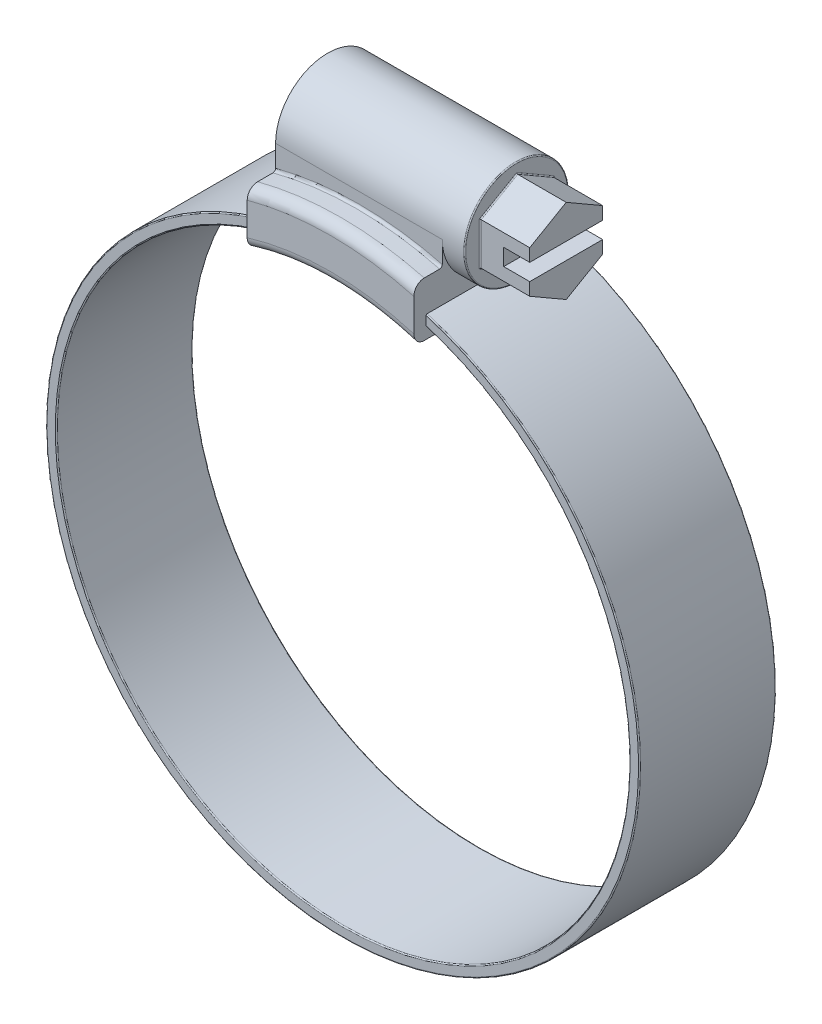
ISO-10303-21;
HEADER;
FILE_DESCRIPTION(('STEP AP214'),'2;1');
FILE_NAME('part.step','',(''),(''),'','','');
FILE_SCHEMA(('AUTOMOTIVE_DESIGN { 1 0 10303 214 1 1 1 1 }'));
ENDSEC;
DATA;
#1=APPLICATION_CONTEXT('core data for automotive mechanical design processes');
#2=APPLICATION_PROTOCOL_DEFINITION('international standard','automotive_design',2000,#1);
#3=PRODUCT_CONTEXT('',#1,'mechanical');
#4=PRODUCT('Part','Part','',(#3));
#5=PRODUCT_RELATED_PRODUCT_CATEGORY('part','',(#4));
#6=PRODUCT_DEFINITION_FORMATION('','',#4);
#7=PRODUCT_DEFINITION_CONTEXT('part definition',#1,'design');
#8=PRODUCT_DEFINITION('design','',#6,#7);
#9=PRODUCT_DEFINITION_SHAPE('','',#8);
#10=(LENGTH_UNIT() NAMED_UNIT(*) SI_UNIT(.MILLI.,.METRE.));
#11=(NAMED_UNIT(*) PLANE_ANGLE_UNIT() SI_UNIT($,.RADIAN.));
#12=(NAMED_UNIT(*) SI_UNIT($,.STERADIAN.) SOLID_ANGLE_UNIT());
#13=UNCERTAINTY_MEASURE_WITH_UNIT(LENGTH_MEASURE(1.E-05),#10,'distance_accuracy_value','');
#14=(GEOMETRIC_REPRESENTATION_CONTEXT(3) GLOBAL_UNCERTAINTY_ASSIGNED_CONTEXT((#13)) GLOBAL_UNIT_ASSIGNED_CONTEXT((#10,
#11,#12)) REPRESENTATION_CONTEXT('',''));
#15=CARTESIAN_POINT('',(0.,0.,0.));
#16=DIRECTION('',(0.,0.,1.));
#17=DIRECTION('',(1.,0.,0.));
#18=AXIS2_PLACEMENT_3D('',#15,#16,#17);
#19=CARTESIAN_POINT('',(14.9,0.,0.));
#20=DIRECTION('',(1.,0.,0.));
#21=DIRECTION('',(0.,0.,-1.));
#22=AXIS2_PLACEMENT_3D('',#19,#20,#21);
#23=PLANE('',#22);
#24=DIRECTION('',(0.,-0.000111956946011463,0.999999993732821));
#25=VECTOR('',#24,1.);
#26=CARTESIAN_POINT('',(14.9,33.5999995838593,0.0037617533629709));
#27=LINE('',#26,#25);
#28=CARTESIAN_POINT('',(14.9,33.6003918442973,-3.49991041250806));
#29=VERTEX_POINT('',#28);
#30=CARTESIAN_POINT('',(14.9,33.5996081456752,3.50008954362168));
#31=VERTEX_POINT('',#30);
#32=EDGE_CURVE('E292',#29,#31,#27,.T.);
#33=ORIENTED_EDGE('',*,*,#32,.F.);
#34=DIRECTION('',(0.,0.999999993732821,0.000111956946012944));
#35=VECTOR('',#34,1.);
#36=CARTESIAN_POINT('',(14.9,30.7796659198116,-3.50022621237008));
#37=LINE('',#36,#35);
#38=CARTESIAN_POINT('',(14.9,34.8211177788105,-3.49977374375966));
#39=VERTEX_POINT('',#38);
#40=EDGE_CURVE('E312',#29,#39,#37,.T.);
#41=ORIENTED_EDGE('',*,*,#40,.T.);
#42=DIRECTION('',(0.,0.499903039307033,0.866081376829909));
#43=VECTOR('',#42,1.);
#44=CARTESIAN_POINT('',(14.9,34.8211177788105,-3.49977374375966));
#45=LINE('',#44,#43);
#46=CARTESIAN_POINT('',(14.9,36.8414518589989,0.000452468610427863));
#47=VERTEX_POINT('',#46);
#48=EDGE_CURVE('E311',#39,#47,#45,.T.);
#49=ORIENTED_EDGE('',*,*,#48,.T.);
#50=DIRECTION('',(0.,-0.500096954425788,0.865969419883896));
#51=VECTOR('',#50,1.);
#52=CARTESIAN_POINT('',(14.9,36.8414518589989,0.000452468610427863));
#53=LINE('',#52,#51);
#54=CARTESIAN_POINT('',(14.9,34.8203340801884,3.50022621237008));
#55=VERTEX_POINT('',#54);
#56=EDGE_CURVE('E317',#47,#55,#53,.T.);
#57=ORIENTED_EDGE('',*,*,#56,.T.);
#58=DIRECTION('',(0.,-0.999999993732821,-0.000111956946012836));
#59=VECTOR('',#58,1.);
#60=CARTESIAN_POINT('',(14.9,34.8203340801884,3.50022621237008));
#61=LINE('',#60,#59);
#62=EDGE_CURVE('E325',#55,#31,#61,.T.);
#63=ORIENTED_EDGE('',*,*,#62,.T.);
#64=EDGE_LOOP('',(#33,#41,#49,#57,#63));
#65=FACE_BOUND('',#64,.T.);
#66=ADVANCED_FACE('F47',(#65),#23,.T.);
#67=CARTESIAN_POINT('',(10.15,32.8,0.));
#68=DIRECTION('',(1.,0.,0.));
#69=DIRECTION('',(0.,0.,-1.));
#70=AXIS2_PLACEMENT_3D('',#67,#68,#69);
#71=PLANE('',#70);
#72=DIRECTION('',(0.,0.499903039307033,0.866081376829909));
#73=VECTOR('',#72,1.);
#74=CARTESIAN_POINT('',(10.15,35.9178929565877,-1.79965094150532));
#75=LINE('',#74,#73);
#76=CARTESIAN_POINT('',(10.15,36.9569219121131,0.000465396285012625));
#77=VERTEX_POINT('',#76);
#78=CARTESIAN_POINT('',(10.15,34.8788640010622,-3.59976727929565));
#79=VERTEX_POINT('',#78);
#80=EDGE_CURVE('E460',#77,#79,#75,.F.);
#81=ORIENTED_EDGE('',*,*,#80,.T.);
#82=DIRECTION('',(0.,0.999999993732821,0.000111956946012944));
#83=VECTOR('',#82,1.);
#84=CARTESIAN_POINT('',(10.15,32.8004030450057,-3.59999997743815));
#85=LINE('',#84,#83);
#86=CARTESIAN_POINT('',(10.15,30.7219420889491,-3.60023267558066));
#87=VERTEX_POINT('',#86);
#88=EDGE_CURVE('E472',#79,#87,#85,.F.);
#89=ORIENTED_EDGE('',*,*,#88,.T.);
#90=DIRECTION('',(0.,0.500096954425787,-0.865969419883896));
#91=VECTOR('',#90,1.);
#92=CARTESIAN_POINT('',(10.15,29.682510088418,-1.80034903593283));
#93=LINE('',#92,#91);
#94=CARTESIAN_POINT('',(10.15,28.6430780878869,-0.000465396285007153));
#95=VERTEX_POINT('',#94);
#96=EDGE_CURVE('E469',#87,#95,#93,.F.);
#97=ORIENTED_EDGE('',*,*,#96,.T.);
#98=DIRECTION('',(0.,-0.499903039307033,-0.866081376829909));
#99=VECTOR('',#98,1.);
#100=CARTESIAN_POINT('',(10.15,29.6821070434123,1.79965094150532));
#101=LINE('',#100,#99);
#102=CARTESIAN_POINT('',(10.15,30.7211359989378,3.59976727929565));
#103=VERTEX_POINT('',#102);
#104=EDGE_CURVE('E466',#95,#103,#101,.F.);
#105=ORIENTED_EDGE('',*,*,#104,.T.);
#106=DIRECTION('',(0.,-0.999999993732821,-0.000111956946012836));
#107=VECTOR('',#106,1.);
#108=CARTESIAN_POINT('',(10.15,32.7995969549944,3.59999997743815));
#109=LINE('',#108,#107);
#110=CARTESIAN_POINT('',(10.15,34.8780579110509,3.60023267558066));
#111=VERTEX_POINT('',#110);
#112=EDGE_CURVE('E463',#103,#111,#109,.F.);
#113=ORIENTED_EDGE('',*,*,#112,.T.);
#114=DIRECTION('',(0.,-0.500096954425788,0.865969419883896));
#115=VECTOR('',#114,1.);
#116=CARTESIAN_POINT('',(10.15,35.917489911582,1.80034903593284));
#117=LINE('',#116,#115);
#118=EDGE_CURVE('E457',#111,#77,#117,.F.);
#119=ORIENTED_EDGE('',*,*,#118,.T.);
#120=EDGE_LOOP('',(#81,#89,#97,#105,#113,#119));
#121=FACE_BOUND('',#120,.T.);
#122=CARTESIAN_POINT('',(10.15,32.8,0.));
#123=DIRECTION('',(1.,0.,0.));
#124=DIRECTION('',(0.,0.,-1.));
#125=AXIS2_PLACEMENT_3D('',#122,#123,#124);
#126=CIRCLE('',#125,4.9);
#127=CARTESIAN_POINT('',(10.15,32.8,-4.9));
#128=VERTEX_POINT('',#127);
#129=EDGE_CURVE('E453',#128,#128,#126,.T.);
#130=ORIENTED_EDGE('',*,*,#129,.T.);
#131=EDGE_LOOP('',(#130));
#132=FACE_BOUND('',#131,.T.);
#133=ADVANCED_FACE('F779',(#121,#132),#71,.T.);
#134=CARTESIAN_POINT('',(8.,25.2636101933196,7.725));
#135=DIRECTION('',(-1.,0.,0.));
#136=DIRECTION('',(0.,0.,1.));
#137=AXIS2_PLACEMENT_3D('',#134,#135,#136);
#138=PLANE('',#137);
#139=DIRECTION('',(0.,-1.,0.));
#140=VECTOR('',#139,1.);
#141=CARTESIAN_POINT('',(8.,0.,6.55));
#142=LINE('',#141,#140);
#143=CARTESIAN_POINT('',(8.,27.2499541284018,6.55));
#144=VERTEX_POINT('',#143);
#145=CARTESIAN_POINT('',(8.,26.4151471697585,6.55));
#146=VERTEX_POINT('',#145);
#147=EDGE_CURVE('E416',#144,#146,#142,.T.);
#148=ORIENTED_EDGE('',*,*,#147,.F.);
#149=CARTESIAN_POINT('',(8.,27.2499541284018,6.55));
#150=CARTESIAN_POINT('',(8.,27.2560013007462,6.55000392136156));
#151=CARTESIAN_POINT('',(8.,27.2620485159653,6.54949518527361));
#152=CARTESIAN_POINT('',(8.,27.2739771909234,6.54747936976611));
#153=CARTESIAN_POINT('',(8.,27.2798585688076,6.54597180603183));
#154=CARTESIAN_POINT('',(8.,27.2912886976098,6.54198355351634));
#155=CARTESIAN_POINT('',(8.,27.2968371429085,6.53950198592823));
#156=CARTESIAN_POINT('',(8.,27.3074244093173,6.53362499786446));
#157=CARTESIAN_POINT('',(8.,27.3124635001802,6.53023006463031));
#158=CARTESIAN_POINT('',(8.,27.3217747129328,6.52268840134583));
#159=CARTESIAN_POINT('',(8.,27.32606038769,6.51855842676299));
#160=CARTESIAN_POINT('',(8.,27.3338436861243,6.50960982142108));
#161=CARTESIAN_POINT('',(8.,27.3373412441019,6.50479113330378));
#162=CARTESIAN_POINT('',(8.,27.3432989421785,6.49480806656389));
#163=CARTESIAN_POINT('',(8.,27.3457945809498,6.48966483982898));
#164=CARTESIAN_POINT('',(8.,27.3498477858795,6.47902401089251));
#165=CARTESIAN_POINT('',(8.,27.3514064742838,6.47352684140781));
#166=CARTESIAN_POINT('',(8.,27.3530304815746,6.46498278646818));
#167=CARTESIAN_POINT('',(8.,27.3534533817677,6.46199976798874));
#168=CARTESIAN_POINT('',(8.,27.3540173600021,6.45601167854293));
#169=CARTESIAN_POINT('',(8.,27.3541588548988,6.45300664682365));
#170=CARTESIAN_POINT('',(8.,27.3541587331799,6.45000000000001));
#171=B_SPLINE_CURVE_WITH_KNOTS('',3,(#149,#150,#151,#152,#153,#154,#155,#156,#157,#158,#159,
#160,#161,#162,#163,#164,#165,#166,#167,#168,#169,#170),.UNSPECIFIED.,.F.,.F.,(4,2,2,2,2,2,2,2,
2,2,4),(0.,0.018120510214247,0.0362498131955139,0.0543955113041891,0.072531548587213,
0.090297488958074,0.108064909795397,0.125131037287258,0.142176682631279,0.15120350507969,
0.160216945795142),.UNSPECIFIED.);
#172=CARTESIAN_POINT('',(8.,27.3541587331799,6.45));
#173=VERTEX_POINT('',#172);
#174=EDGE_CURVE('E719',#144,#173,#171,.T.);
#175=ORIENTED_EDGE('',*,*,#174,.T.);
#176=DIRECTION('',(0.,0.,-1.));
#177=VECTOR('',#176,1.);
#178=CARTESIAN_POINT('',(8.,27.3541587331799,6.55));
#179=LINE('',#178,#177);
#180=CARTESIAN_POINT('',(8.,27.3541587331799,-6.45));
#181=VERTEX_POINT('',#180);
#182=EDGE_CURVE('E420',#173,#181,#179,.T.);
#183=ORIENTED_EDGE('',*,*,#182,.T.);
#184=CARTESIAN_POINT('',(8.,27.3541587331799,-6.45));
#185=CARTESIAN_POINT('',(8.,27.3541644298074,-6.45546251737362));
#186=CARTESIAN_POINT('',(8.,27.3536927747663,-6.46092228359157));
#187=CARTESIAN_POINT('',(8.,27.3518384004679,-6.47167456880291));
#188=CARTESIAN_POINT('',(8.,27.3504574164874,-6.47696738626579));
#189=CARTESIAN_POINT('',(8.,27.3468275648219,-6.48724641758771));
#190=CARTESIAN_POINT('',(8.,27.3445786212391,-6.49223260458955));
#191=CARTESIAN_POINT('',(8.,27.3392896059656,-6.50176575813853));
#192=CARTESIAN_POINT('',(8.,27.3362494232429,-6.50631266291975));
#193=CARTESIAN_POINT('',(8.,27.3294150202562,-6.5149265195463));
#194=CARTESIAN_POINT('',(8.,27.325608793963,-6.51898393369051));
#195=CARTESIAN_POINT('',(8.,27.3173911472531,-6.52643115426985));
#196=CARTESIAN_POINT('',(8.,27.3129795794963,-6.52982079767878));
#197=CARTESIAN_POINT('',(8.,27.3034979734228,-6.53597351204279));
#198=CARTESIAN_POINT('',(8.,27.2984092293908,-6.53870773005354));
#199=CARTESIAN_POINT('',(8.,27.2878567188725,-6.54331767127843));
#200=CARTESIAN_POINT('',(8.,27.2823929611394,-6.54519341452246));
#201=CARTESIAN_POINT('',(8.,27.2724299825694,-6.54774396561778));
#202=CARTESIAN_POINT('',(8.,27.2679735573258,-6.54858957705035));
#203=CARTESIAN_POINT('',(8.,27.2589964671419,-6.54971762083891));
#204=CARTESIAN_POINT('',(8.,27.2544759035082,-6.55000085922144));
#205=CARTESIAN_POINT('',(8.,27.2499541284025,-6.55000000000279));
#206=B_SPLINE_CURVE_WITH_KNOTS('',3,(#184,#185,#186,#187,#188,#189,#190,#191,#192,#193,#194,
#195,#196,#197,#198,#199,#200,#201,#202,#203,#204,#205),.UNSPECIFIED.,.F.,.F.,(4,2,2,2,2,2,2,2,
2,2,4),(0.,0.01636303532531,0.0326949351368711,0.0490282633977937,0.0653638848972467,
0.0819788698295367,0.098597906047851,0.115851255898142,0.133104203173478,0.146677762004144,
0.160231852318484),.UNSPECIFIED.);
#207=CARTESIAN_POINT('',(8.,27.2499541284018,-6.55));
#208=VERTEX_POINT('',#207);
#209=EDGE_CURVE('E574',#181,#208,#206,.T.);
#210=ORIENTED_EDGE('',*,*,#209,.T.);
#211=DIRECTION('',(0.,-1.,0.));
#212=VECTOR('',#211,1.);
#213=CARTESIAN_POINT('',(8.,0.,-6.55));
#214=LINE('',#213,#212);
#215=CARTESIAN_POINT('',(8.,26.4151471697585,-6.55));
#216=VERTEX_POINT('',#215);
#217=EDGE_CURVE('E412',#208,#216,#214,.T.);
#218=ORIENTED_EDGE('',*,*,#217,.T.);
#219=CARTESIAN_POINT('',(8.,26.4151471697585,-6.55));
#220=CARTESIAN_POINT('',(8.,26.4090701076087,-6.55000384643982));
#221=CARTESIAN_POINT('',(8.,26.4029929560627,-6.5494927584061));
#222=CARTESIAN_POINT('',(8.,26.3910047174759,-6.54746741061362));
#223=CARTESIAN_POINT('',(8.,26.3850937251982,-6.54595259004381));
#224=CARTESIAN_POINT('',(8.,26.3736059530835,-6.54194469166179));
#225=CARTESIAN_POINT('',(8.,26.3680294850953,-6.53945071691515));
#226=CARTESIAN_POINT('',(8.,26.3573894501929,-6.53354324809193));
#227=CARTESIAN_POINT('',(8.,26.352325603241,-6.53013025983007));
#228=CARTESIAN_POINT('',(8.,26.3429761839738,-6.52255124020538));
#229=CARTESIAN_POINT('',(8.,26.3386761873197,-6.51840302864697));
#230=CARTESIAN_POINT('',(8.,26.330870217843,-6.50941376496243));
#231=CARTESIAN_POINT('',(8.,26.3273643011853,-6.50457266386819));
#232=CARTESIAN_POINT('',(8.,26.3214071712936,-6.49455664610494));
#233=CARTESIAN_POINT('',(8.,26.3189176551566,-6.48940447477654));
#234=CARTESIAN_POINT('',(8.,26.3148812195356,-6.47874621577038));
#235=CARTESIAN_POINT('',(8.,26.313333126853,-6.47324057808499));
#236=CARTESIAN_POINT('',(8.,26.3117389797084,-6.46473651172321));
#237=CARTESIAN_POINT('',(8.,26.311328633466,-6.4618021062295));
#238=CARTESIAN_POINT('',(8.,26.3107814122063,-6.45591230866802));
#239=CARTESIAN_POINT('',(8.,26.3106441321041,-6.45295695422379));
#240=CARTESIAN_POINT('',(8.,26.3106442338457,-6.45000000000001));
#241=B_SPLINE_CURVE_WITH_KNOTS('',3,(#219,#220,#221,#222,#223,#224,#225,#226,#227,#228,#229,
#230,#231,#232,#233,#234,#235,#236,#237,#238,#239,#240),.UNSPECIFIED.,.F.,.F.,(4,2,2,2,2,2,2,2,
2,2,4),(0.,0.0182101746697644,0.0364305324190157,0.0546676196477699,0.0728946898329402,
0.0907288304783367,0.108564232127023,0.125646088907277,0.142706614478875,0.151584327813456,
0.160448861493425),.UNSPECIFIED.);
#242=CARTESIAN_POINT('',(8.,26.3106442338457,-6.45));
#243=VERTEX_POINT('',#242);
#244=EDGE_CURVE('E523',#216,#243,#241,.T.);
#245=ORIENTED_EDGE('',*,*,#244,.T.);
#246=DIRECTION('',(0.,0.,-1.));
#247=VECTOR('',#246,1.);
#248=CARTESIAN_POINT('',(8.,26.3106442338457,6.55));
#249=LINE('',#248,#247);
#250=CARTESIAN_POINT('',(8.,26.3106442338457,6.45));
#251=VERTEX_POINT('',#250);
#252=EDGE_CURVE('E436',#251,#243,#249,.T.);
#253=ORIENTED_EDGE('',*,*,#252,.F.);
#254=CARTESIAN_POINT('',(8.,26.3106442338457,6.45));
#255=CARTESIAN_POINT('',(8.,26.3106384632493,6.45545059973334));
#256=CARTESIAN_POINT('',(8.,26.3111096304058,6.46089833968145));
#257=CARTESIAN_POINT('',(8.,26.3129615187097,6.4716262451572));
#258=CARTESIAN_POINT('',(8.,26.3143404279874,6.47690672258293));
#259=CARTESIAN_POINT('',(8.,26.3179638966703,6.48716142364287));
#260=CARTESIAN_POINT('',(8.,26.3202085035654,6.49213563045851));
#261=CARTESIAN_POINT('',(8.,26.3254859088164,6.50164646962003));
#262=CARTESIAN_POINT('',(8.,26.3285188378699,6.5061830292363));
#263=CARTESIAN_POINT('',(8.,26.3353396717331,6.51478463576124));
#264=CARTESIAN_POINT('',(8.,26.3391404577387,6.51883945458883));
#265=CARTESIAN_POINT('',(8.,26.3473452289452,6.52628443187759));
#266=CARTESIAN_POINT('',(8.,26.3517493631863,6.52967442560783));
#267=CARTESIAN_POINT('',(8.,26.3612274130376,6.53584095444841));
#268=CARTESIAN_POINT('',(8.,26.3663213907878,6.53858662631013));
#269=CARTESIAN_POINT('',(8.,26.3768854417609,6.54322076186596));
#270=CARTESIAN_POINT('',(8.,26.382355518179,6.54510921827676));
#271=CARTESIAN_POINT('',(8.,26.3923805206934,6.5476967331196));
#272=CARTESIAN_POINT('',(8.,26.396893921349,6.54856002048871));
#273=CARTESIAN_POINT('',(8.,26.4059869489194,6.54971168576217));
#274=CARTESIAN_POINT('',(8.,26.4105664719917,6.55000088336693));
#275=CARTESIAN_POINT('',(8.,26.4151471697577,6.55000000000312));
#276=B_SPLINE_CURVE_WITH_KNOTS('',3,(#254,#255,#256,#257,#258,#259,#260,#261,#262,#263,#264,
#265,#266,#267,#268,#269,#270,#271,#272,#273,#274,#275),.UNSPECIFIED.,.F.,.F.,(4,2,2,2,2,2,2,2,
2,2,4),(0.,0.0163271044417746,0.0326217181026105,0.0489172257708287,0.0652154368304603,
0.0818139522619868,0.0984165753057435,0.115700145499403,0.132983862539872,0.146734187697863,
0.160464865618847),.UNSPECIFIED.);
#277=EDGE_CURVE('E561',#251,#146,#276,.T.);
#278=ORIENTED_EDGE('',*,*,#277,.T.);
#279=EDGE_LOOP('',(#148,#175,#183,#210,#218,#245,#253,#278));
#280=FACE_BOUND('',#279,.T.);
#281=DIRECTION('',(0.,1.,0.));
#282=VECTOR('',#281,1.);
#283=CARTESIAN_POINT('',(8.,25.2636101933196,7.725));
#284=LINE('',#283,#282);
#285=CARTESIAN_POINT('',(8.,26.3106442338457,7.725));
#286=VERTEX_POINT('',#285);
#287=CARTESIAN_POINT('',(8.,29.4321253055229,7.725));
#288=VERTEX_POINT('',#287);
#289=EDGE_CURVE('E385',#286,#288,#284,.T.);
#290=ORIENTED_EDGE('',*,*,#289,.F.);
#291=CARTESIAN_POINT('',(8.,26.3106442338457,7.725));
#292=CARTESIAN_POINT('',(8.,26.2497151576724,7.72503769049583));
#293=CARTESIAN_POINT('',(8.,26.1887876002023,7.71990447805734));
#294=CARTESIAN_POINT('',(8.,26.0686021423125,7.69957660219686));
#295=CARTESIAN_POINT('',(8.,26.0093451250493,7.68437671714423));
#296=CARTESIAN_POINT('',(8.,25.894184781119,7.64417916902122));
#297=CARTESIAN_POINT('',(8.,25.8382843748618,7.6191731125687));
#298=CARTESIAN_POINT('',(8.,25.7316173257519,7.55995297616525));
#299=CARTESIAN_POINT('',(8.,25.6808480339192,7.52574368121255));
#300=CARTESIAN_POINT('',(8.,25.5870597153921,7.4497416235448));
#301=CARTESIAN_POINT('',(8.,25.5439026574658,7.40811947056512));
#302=CARTESIAN_POINT('',(8.,25.4655711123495,7.31790976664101));
#303=CARTESIAN_POINT('',(8.,25.430397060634,7.26932183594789));
#304=CARTESIAN_POINT('',(8.,25.3707195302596,7.16886661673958));
#305=CARTESIAN_POINT('',(8.,25.345815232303,7.11723709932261));
#306=CARTESIAN_POINT('',(8.,25.3054884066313,7.010429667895));
#307=CARTESIAN_POINT('',(8.,25.2900536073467,6.95525644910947));
#308=CARTESIAN_POINT('',(8.,25.2743144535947,6.8704698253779));
#309=CARTESIAN_POINT('',(8.,25.2703022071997,6.84150056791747));
#310=CARTESIAN_POINT('',(8.,25.2649515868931,6.78335927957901));
#311=CARTESIAN_POINT('',(8.,25.26360928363,6.75418761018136));
#312=CARTESIAN_POINT('',(8.,25.2636101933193,6.72500000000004));
#313=B_SPLINE_CURVE_WITH_KNOTS('',3,(#291,#292,#293,#294,#295,#296,#297,#298,#299,#300,#301,
#302,#303,#304,#305,#306,#307,#308,#309,#310,#311,#312),.UNSPECIFIED.,.F.,.F.,(4,2,2,2,2,2,2,2,
2,2,4),(0.,0.182572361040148,0.36523949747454,0.548063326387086,0.730792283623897,
0.909759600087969,1.08873667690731,1.2598526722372,1.4307464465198,1.51837615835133,
1.60587680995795),.UNSPECIFIED.);
#314=CARTESIAN_POINT('',(8.,25.2636101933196,6.725));
#315=VERTEX_POINT('',#314);
#316=EDGE_CURVE('E694',#286,#315,#313,.T.);
#317=ORIENTED_EDGE('',*,*,#316,.T.);
#318=DIRECTION('',(0.,0.,-1.));
#319=VECTOR('',#318,1.);
#320=CARTESIAN_POINT('',(8.,25.2636101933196,7.725));
#321=LINE('',#320,#319);
#322=CARTESIAN_POINT('',(8.,25.2636101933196,-6.725));
#323=VERTEX_POINT('',#322);
#324=EDGE_CURVE('E400',#315,#323,#321,.T.);
#325=ORIENTED_EDGE('',*,*,#324,.T.);
#326=CARTESIAN_POINT('',(8.,25.2636101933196,-6.725));
#327=CARTESIAN_POINT('',(8.,25.2636096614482,-6.75219642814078));
#328=CARTESIAN_POINT('',(8.,25.2647747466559,-6.77937946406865));
#329=CARTESIAN_POINT('',(8.,25.2694179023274,-6.83354332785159));
#330=CARTESIAN_POINT('',(8.,25.2728956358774,-6.86052418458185));
#331=CARTESIAN_POINT('',(8.,25.2867437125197,-6.94075449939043));
#332=CARTESIAN_POINT('',(8.,25.3005291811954,-6.99345389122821));
#333=CARTESIAN_POINT('',(8.,25.33671632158,-7.09576761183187));
#334=CARTESIAN_POINT('',(8.,25.3591180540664,-7.14538191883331));
#335=CARTESIAN_POINT('',(8.,25.4117741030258,-7.24026058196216));
#336=CARTESIAN_POINT('',(8.,25.4420300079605,-7.28552405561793));
#337=CARTESIAN_POINT('',(8.,25.51011106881,-7.37144413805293));
#338=CARTESIAN_POINT('',(8.,25.5480770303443,-7.41198896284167));
#339=CARTESIAN_POINT('',(8.,25.6300239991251,-7.48646152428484));
#340=CARTESIAN_POINT('',(8.,25.6740065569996,-7.52038754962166));
#341=CARTESIAN_POINT('',(8.,25.7687968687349,-7.58223795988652));
#342=CARTESIAN_POINT('',(8.,25.8198199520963,-7.6098320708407));
#343=CARTESIAN_POINT('',(8.,25.9256446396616,-7.65644212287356));
#344=CARTESIAN_POINT('',(8.,25.9804462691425,-7.67545800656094));
#345=CARTESIAN_POINT('',(8.,26.0811482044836,-7.70162161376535));
#346=CARTESIAN_POINT('',(8.,26.1266377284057,-7.71038200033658));
#347=CARTESIAN_POINT('',(8.,26.2182961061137,-7.72207166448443));
#348=CARTESIAN_POINT('',(8.,26.2644639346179,-7.72500898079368));
#349=CARTESIAN_POINT('',(8.,26.3106442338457,-7.725));
#350=B_SPLINE_CURVE_WITH_KNOTS('',3,(#326,#327,#328,#329,#330,#331,#332,#333,#334,#335,#336,
#337,#338,#339,#340,#341,#342,#343,#344,#345,#346,#347,#348,#349),.UNSPECIFIED.,.F.,.F.,(4,2,2,
2,2,2,2,2,2,2,2,4),(0.,0.0815379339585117,0.163063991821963,0.325635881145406,0.488208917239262,
0.650814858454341,0.816711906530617,0.98265179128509,1.15590264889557,1.32915466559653,
1.46776983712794,1.60619351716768),.UNSPECIFIED.);
#351=CARTESIAN_POINT('',(8.,26.3106442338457,-7.725));
#352=VERTEX_POINT('',#351);
#353=EDGE_CURVE('E687',#323,#352,#350,.T.);
#354=ORIENTED_EDGE('',*,*,#353,.T.);
#355=DIRECTION('',(0.,1.,0.));
#356=VECTOR('',#355,1.);
#357=CARTESIAN_POINT('',(8.,25.2636101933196,-7.725));
#358=LINE('',#357,#356);
#359=CARTESIAN_POINT('',(8.,29.4321253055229,-7.725));
#360=VERTEX_POINT('',#359);
#361=EDGE_CURVE('E386',#352,#360,#358,.T.);
#362=ORIENTED_EDGE('',*,*,#361,.T.);
#363=CARTESIAN_POINT('',(8.,29.4321253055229,-7.725));
#364=CARTESIAN_POINT('',(8.,29.4919089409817,-7.72504105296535));
#365=CARTESIAN_POINT('',(8.,29.551692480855,-7.72000972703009));
#366=CARTESIAN_POINT('',(8.,29.6696105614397,-7.70007534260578));
#367=CARTESIAN_POINT('',(8.,29.7277445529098,-7.68516903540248));
#368=CARTESIAN_POINT('',(8.,29.8407232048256,-7.64574059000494));
#369=CARTESIAN_POINT('',(8.,29.8955649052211,-7.62120994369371));
#370=CARTESIAN_POINT('',(8.,30.0002246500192,-7.56313674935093));
#371=CARTESIAN_POINT('',(8.,30.0500451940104,-7.52959871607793));
#372=CARTESIAN_POINT('',(8.,30.1422556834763,-7.45504369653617));
#373=CARTESIAN_POINT('',(8.,30.1847636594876,-7.414172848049));
#374=CARTESIAN_POINT('',(8.,30.2620377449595,-7.32564378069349));
#375=CARTESIAN_POINT('',(8.,30.2968029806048,-7.27798479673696));
#376=CARTESIAN_POINT('',(8.,30.3563615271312,-7.17894064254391));
#377=CARTESIAN_POINT('',(8.,30.3814459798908,-7.12773027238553));
#378=CARTESIAN_POINT('',(8.,30.4223444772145,-7.02175855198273));
#379=CARTESIAN_POINT('',(8.,30.4381685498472,-6.96700111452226));
#380=CARTESIAN_POINT('',(8.,30.455109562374,-6.88063537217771));
#381=CARTESIAN_POINT('',(8.,30.4596396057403,-6.84965937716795));
#382=CARTESIAN_POINT('',(8.,30.465681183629,-6.78746077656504));
#383=CARTESIAN_POINT('',(8.,30.4671971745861,-6.75623860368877));
#384=CARTESIAN_POINT('',(8.,30.4671954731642,-6.725));
#385=B_SPLINE_CURVE_WITH_KNOTS('',3,(#363,#364,#365,#366,#367,#368,#369,#370,#371,#372,#373,
#374,#375,#376,#377,#378,#379,#380,#381,#382,#383,#384),.UNSPECIFIED.,.F.,.F.,(4,2,2,2,2,2,2,2,
2,2,4),(0.,0.179141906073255,0.358342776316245,0.537702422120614,0.716972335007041,
0.89300197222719,1.06905146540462,1.23929298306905,1.40934980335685,1.50313539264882,
1.59678221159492),.UNSPECIFIED.);
#386=CARTESIAN_POINT('',(8.,30.4671954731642,-6.725));
#387=VERTEX_POINT('',#386);
#388=EDGE_CURVE('E677',#360,#387,#385,.T.);
#389=ORIENTED_EDGE('',*,*,#388,.T.);
#390=DIRECTION('',(0.,0.,-1.));
#391=VECTOR('',#390,1.);
#392=CARTESIAN_POINT('',(8.,30.4671954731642,7.725));
#393=LINE('',#392,#391);
#394=CARTESIAN_POINT('',(8.,30.4671954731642,-5.25));
#395=VERTEX_POINT('',#394);
#396=EDGE_CURVE('E390',#395,#387,#393,.T.);
#397=ORIENTED_EDGE('',*,*,#396,.F.);
#398=CARTESIAN_POINT('',(8.,30.4671954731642,-5.25));
#399=CARTESIAN_POINT('',(8.,30.4671816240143,-5.23626752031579));
#400=CARTESIAN_POINT('',(8.,30.4683644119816,-5.22254134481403));
#401=CARTESIAN_POINT('',(8.,30.4730177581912,-5.19550558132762));
#402=CARTESIAN_POINT('',(8.,30.4764844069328,-5.18219532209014));
#403=CARTESIAN_POINT('',(8.,30.4856013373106,-5.15634385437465));
#404=CARTESIAN_POINT('',(8.,30.4912519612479,-5.14380276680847));
#405=CARTESIAN_POINT('',(8.,30.504548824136,-5.11982858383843));
#406=CARTESIAN_POINT('',(8.,30.5121952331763,-5.10839558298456));
#407=CARTESIAN_POINT('',(8.,30.5293694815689,-5.08677799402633));
#408=CARTESIAN_POINT('',(8.,30.5389224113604,-5.07661335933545));
#409=CARTESIAN_POINT('',(8.,30.5595545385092,-5.05797205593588));
#410=CARTESIAN_POINT('',(8.,30.5706341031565,-5.04949579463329));
#411=CARTESIAN_POINT('',(8.,30.5943703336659,-5.03419283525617));
#412=CARTESIAN_POINT('',(8.,30.6070653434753,-5.02742566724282));
#413=CARTESIAN_POINT('',(8.,30.6333874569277,-5.01605004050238));
#414=CARTESIAN_POINT('',(8.,30.647014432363,-5.01144128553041));
#415=CARTESIAN_POINT('',(8.,30.6714904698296,-5.00531637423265));
#416=CARTESIAN_POINT('',(8.,30.6822231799,-5.00332389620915));
#417=CARTESIAN_POINT('',(8.,30.7038362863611,-5.0006656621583));
#418=CARTESIAN_POINT('',(8.,30.7147164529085,-4.99999803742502));
#419=CARTESIAN_POINT('',(8.,30.7256000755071,-5.));
#420=B_SPLINE_CURVE_WITH_KNOTS('',3,(#398,#399,#400,#401,#402,#403,#404,#405,#406,#407,#408,
#409,#410,#411,#412,#413,#414,#415,#416,#417,#418,#419),.UNSPECIFIED.,.F.,.F.,(4,2,2,2,2,2,2,2,
2,2,4),(0.,0.0411370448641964,0.0822038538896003,0.123277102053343,0.164353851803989,
0.206011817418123,0.247679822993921,0.290644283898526,0.333602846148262,0.366272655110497,
0.398896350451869),.UNSPECIFIED.);
#421=CARTESIAN_POINT('',(8.,30.7256000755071,-5.));
#422=VERTEX_POINT('',#421);
#423=EDGE_CURVE('E650',#395,#422,#420,.T.);
#424=ORIENTED_EDGE('',*,*,#423,.T.);
#425=DIRECTION('',(0.,-1.,0.));
#426=VECTOR('',#425,1.);
#427=CARTESIAN_POINT('',(8.,30.4671954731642,-5.));
#428=LINE('',#427,#426);
#429=CARTESIAN_POINT('',(8.,32.8,-5.));
#430=VERTEX_POINT('',#429);
#431=EDGE_CURVE('E370',#430,#422,#428,.T.);
#432=ORIENTED_EDGE('',*,*,#431,.F.);
#433=CARTESIAN_POINT('',(8.,32.8,0.));
#434=DIRECTION('',(1.,0.,0.));
#435=DIRECTION('',(0.,0.,-1.));
#436=AXIS2_PLACEMENT_3D('',#433,#434,#435);
#437=CIRCLE('',#436,5.00000000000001);
#438=CARTESIAN_POINT('',(8.,32.8,5.00000000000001));
#439=VERTEX_POINT('',#438);
#440=EDGE_CURVE('E352',#439,#430,#437,.T.);
#441=ORIENTED_EDGE('',*,*,#440,.F.);
#442=DIRECTION('',(0.,1.,0.));
#443=VECTOR('',#442,1.);
#444=CARTESIAN_POINT('',(8.,32.8,5.));
#445=LINE('',#444,#443);
#446=CARTESIAN_POINT('',(8.,30.7256000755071,5.));
#447=VERTEX_POINT('',#446);
#448=EDGE_CURVE('E367',#447,#439,#445,.T.);
#449=ORIENTED_EDGE('',*,*,#448,.F.);
#450=CARTESIAN_POINT('',(8.,30.7256000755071,5.));
#451=CARTESIAN_POINT('',(8.,30.7107012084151,4.99998976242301));
#452=CARTESIAN_POINT('',(8.,30.6958032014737,5.00124678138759));
#453=CARTESIAN_POINT('',(8.,30.666420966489,5.00622243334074));
#454=CARTESIAN_POINT('',(8.,30.6519368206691,5.00994155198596));
#455=CARTESIAN_POINT('',(8.,30.6237893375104,5.01977237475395));
#456=CARTESIAN_POINT('',(8.,30.6101266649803,5.02588598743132));
#457=CARTESIAN_POINT('',(8.,30.5840487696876,5.040352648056));
#458=CARTESIAN_POINT('',(8.,30.5716329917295,5.0487046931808));
#459=CARTESIAN_POINT('',(8.,30.5486166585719,5.06728904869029));
#460=CARTESIAN_POINT('',(8.,30.5379908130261,5.07749000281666));
#461=CARTESIAN_POINT('',(8.,30.5186682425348,5.09958611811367));
#462=CARTESIAN_POINT('',(8.,30.509971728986,5.11148146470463));
#463=CARTESIAN_POINT('',(8.,30.4950531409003,5.13622293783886));
#464=CARTESIAN_POINT('',(8.,30.488761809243,5.14902736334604));
#465=CARTESIAN_POINT('',(8.,30.4784979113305,5.17552767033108));
#466=CARTESIAN_POINT('',(8.,30.4745228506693,5.18922257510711));
#467=CARTESIAN_POINT('',(8.,30.4702524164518,5.21086458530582));
#468=CARTESIAN_POINT('',(8.,30.4691066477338,5.21865308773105));
#469=CARTESIAN_POINT('',(8.,30.4675785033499,5.23429308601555));
#470=CARTESIAN_POINT('',(8.,30.4671950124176,5.24214447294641));
#471=CARTESIAN_POINT('',(8.,30.4671954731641,5.24999999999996));
#472=B_SPLINE_CURVE_WITH_KNOTS('',3,(#450,#451,#452,#453,#454,#455,#456,#457,#458,#459,#460,
#461,#462,#463,#464,#465,#466,#467,#468,#469,#470,#471),.UNSPECIFIED.,.F.,.F.,(4,2,2,2,2,2,2,2,
2,2,4),(0.,0.0446430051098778,0.0892948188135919,0.133982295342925,0.178649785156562,
0.222620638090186,0.266596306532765,0.309188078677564,0.35173389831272,0.375317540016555,
0.398866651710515),.UNSPECIFIED.);
#473=CARTESIAN_POINT('',(8.,30.4671954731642,5.25));
#474=VERTEX_POINT('',#473);
#475=EDGE_CURVE('E62',#447,#474,#472,.T.);
#476=ORIENTED_EDGE('',*,*,#475,.T.);
#477=CARTESIAN_POINT('',(8.,30.4671954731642,6.725));
#478=VERTEX_POINT('',#477);
#479=EDGE_CURVE('E397',#478,#474,#393,.T.);
#480=ORIENTED_EDGE('',*,*,#479,.F.);
#481=CARTESIAN_POINT('',(8.,30.4671954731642,6.725));
#482=CARTESIAN_POINT('',(8.,30.4671957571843,6.7524602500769));
#483=CARTESIAN_POINT('',(8.,30.4660252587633,6.7799071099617));
#484=CARTESIAN_POINT('',(8.,30.4613588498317,6.83459935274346));
#485=CARTESIAN_POINT('',(8.,30.4578631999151,6.86184475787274));
#486=CARTESIAN_POINT('',(8.,30.4439359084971,6.94288897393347));
#487=CARTESIAN_POINT('',(8.,30.4300637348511,6.99613661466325));
#488=CARTESIAN_POINT('',(8.,30.3936015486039,7.09953188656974));
#489=CARTESIAN_POINT('',(8.,30.3710100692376,7.14967899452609));
#490=CARTESIAN_POINT('',(8.,30.3178393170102,7.24554711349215));
#491=CARTESIAN_POINT('',(8.,30.2872594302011,7.29126778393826));
#492=CARTESIAN_POINT('',(8.,30.218585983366,7.377696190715));
#493=CARTESIAN_POINT('',(8.,30.1803946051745,7.41832608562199));
#494=CARTESIAN_POINT('',(8.,30.0979118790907,7.49283836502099));
#495=CARTESIAN_POINT('',(8.,30.0536191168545,7.52671918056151));
#496=CARTESIAN_POINT('',(8.,29.9587270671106,7.58789683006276));
#497=CARTESIAN_POINT('',(8.,29.9079739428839,7.61495479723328));
#498=CARTESIAN_POINT('',(8.,29.8027454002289,7.66045860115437));
#499=CARTESIAN_POINT('',(8.,29.7482703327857,7.67890524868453));
#500=CARTESIAN_POINT('',(8.,29.6501042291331,7.70353927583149));
#501=CARTESIAN_POINT('',(8.,29.6068683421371,7.71158421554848));
#502=CARTESIAN_POINT('',(8.,29.5198003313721,7.72231469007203));
#503=CARTESIAN_POINT('',(8.,29.4759691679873,7.72500801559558));
#504=CARTESIAN_POINT('',(8.,29.4321253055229,7.725));
#505=B_SPLINE_CURVE_WITH_KNOTS('',3,(#481,#482,#483,#484,#485,#486,#487,#488,#489,#490,#491,
#492,#493,#494,#495,#496,#497,#498,#499,#500,#501,#502,#503,#504),.UNSPECIFIED.,.F.,.F.,(4,2,2,
2,2,2,2,2,2,2,2,4),(0.,0.082329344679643,0.164649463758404,0.328872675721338,0.493123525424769,
0.657387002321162,0.823916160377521,0.99048398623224,1.16225764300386,1.33401512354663,
1.46563072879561,1.5970545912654),.UNSPECIFIED.);
#506=EDGE_CURVE('E669',#478,#288,#505,.T.);
#507=ORIENTED_EDGE('',*,*,#506,.T.);
#508=EDGE_LOOP('',(#290,#317,#325,#354,#362,#389,#397,#424,#432,#441,#449,#476,#480,#507));
#509=FACE_BOUND('',#508,.T.);
#510=ADVANCED_FACE('F538',(#280,#509),#138,.F.);
#511=CARTESIAN_POINT('',(0.,0.,7.725));
#512=DIRECTION('',(0.,0.,-1.));
#513=DIRECTION('',(-1.,0.,0.));
#514=AXIS2_PLACEMENT_3D('',#511,#512,#513);
#515=CYLINDRICAL_SURFACE('',#514,31.5);
#516=ORIENTED_EDGE('',*,*,#479,.T.);
#517=CARTESIAN_POINT('',(0.,0.,5.25));
#518=DIRECTION('',(0.,0.,-1.));
#519=DIRECTION('',(-1.,0.,0.));
#520=AXIS2_PLACEMENT_3D('',#517,#518,#519);
#521=CIRCLE('',#520,31.5);
#522=CARTESIAN_POINT('',(-8.,30.4671954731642,5.25));
#523=VERTEX_POINT('',#522);
#524=EDGE_CURVE('E75',#474,#523,#521,.F.);
#525=ORIENTED_EDGE('',*,*,#524,.T.);
#526=DIRECTION('',(0.,0.,-1.));
#527=VECTOR('',#526,1.);
#528=CARTESIAN_POINT('',(-8.,30.4671954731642,7.725));
#529=LINE('',#528,#527);
#530=CARTESIAN_POINT('',(-8.,30.4671954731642,6.725));
#531=VERTEX_POINT('',#530);
#532=EDGE_CURVE('E409',#531,#523,#529,.T.);
#533=ORIENTED_EDGE('',*,*,#532,.F.);
#534=CARTESIAN_POINT('',(0.,0.,6.725));
#535=DIRECTION('',(0.,0.,1.));
#536=DIRECTION('',(1.,0.,0.));
#537=AXIS2_PLACEMENT_3D('',#534,#535,#536);
#538=CIRCLE('',#537,31.5);
#539=EDGE_CURVE('E855',#531,#478,#538,.F.);
#540=ORIENTED_EDGE('',*,*,#539,.T.);
#541=EDGE_LOOP('',(#516,#525,#533,#540));
#542=FACE_BOUND('',#541,.T.);
#543=ADVANCED_FACE('F587',(#542),#515,.T.);
#544=CARTESIAN_POINT('',(-8.,30.4671954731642,-5.25));
#545=VERTEX_POINT('',#544);
#546=CARTESIAN_POINT('',(-8.,30.4671954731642,-6.725));
#547=VERTEX_POINT('',#546);
#548=EDGE_CURVE('E408',#545,#547,#529,.T.);
#549=ORIENTED_EDGE('',*,*,#548,.F.);
#550=CARTESIAN_POINT('',(0.,0.,-5.25));
#551=DIRECTION('',(0.,0.,1.));
#552=DIRECTION('',(1.,0.,0.));
#553=AXIS2_PLACEMENT_3D('',#550,#551,#552);
#554=CIRCLE('',#553,31.5);
#555=EDGE_CURVE('E864',#545,#395,#554,.F.);
#556=ORIENTED_EDGE('',*,*,#555,.T.);
#557=ORIENTED_EDGE('',*,*,#396,.T.);
#558=CARTESIAN_POINT('',(0.,0.,-6.725));
#559=DIRECTION('',(0.,0.,1.));
#560=DIRECTION('',(1.,0.,0.));
#561=AXIS2_PLACEMENT_3D('',#558,#559,#560);
#562=CIRCLE('',#561,31.5);
#563=EDGE_CURVE('E849',#387,#547,#562,.T.);
#564=ORIENTED_EDGE('',*,*,#563,.T.);
#565=EDGE_LOOP('',(#549,#556,#557,#564));
#566=FACE_BOUND('',#565,.T.);
#567=ADVANCED_FACE('F585',(#566),#515,.T.);
#568=CARTESIAN_POINT('',(-8.,30.4671954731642,7.725));
#569=DIRECTION('',(1.,0.,0.));
#570=DIRECTION('',(0.,0.,-1.));
#571=AXIS2_PLACEMENT_3D('',#568,#569,#570);
#572=PLANE('',#571);
#573=DIRECTION('',(0.,0.,-1.));
#574=VECTOR('',#573,1.);
#575=CARTESIAN_POINT('',(-8.,25.2636101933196,7.725));
#576=LINE('',#575,#574);
#577=CARTESIAN_POINT('',(-8.,25.2636101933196,6.725));
#578=VERTEX_POINT('',#577);
#579=CARTESIAN_POINT('',(-8.,25.2636101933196,-6.725));
#580=VERTEX_POINT('',#579);
#581=EDGE_CURVE('E404',#578,#580,#576,.T.);
#582=ORIENTED_EDGE('',*,*,#581,.F.);
#583=CARTESIAN_POINT('',(-8.,25.2636101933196,6.725));
#584=CARTESIAN_POINT('',(-8.,25.2636096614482,6.75219642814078));
#585=CARTESIAN_POINT('',(-8.,25.2647747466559,6.77937946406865));
#586=CARTESIAN_POINT('',(-8.,25.2694179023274,6.83354332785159));
#587=CARTESIAN_POINT('',(-8.,25.2728956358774,6.86052418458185));
#588=CARTESIAN_POINT('',(-8.,25.2867437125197,6.94075449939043));
#589=CARTESIAN_POINT('',(-8.,25.3005291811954,6.99345389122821));
#590=CARTESIAN_POINT('',(-8.,25.33671632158,7.09576761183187));
#591=CARTESIAN_POINT('',(-8.,25.3591180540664,7.14538191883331));
#592=CARTESIAN_POINT('',(-8.,25.4117741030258,7.24026058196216));
#593=CARTESIAN_POINT('',(-8.,25.4420300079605,7.28552405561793));
#594=CARTESIAN_POINT('',(-8.,25.51011106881,7.37144413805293));
#595=CARTESIAN_POINT('',(-8.,25.5480770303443,7.41198896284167));
#596=CARTESIAN_POINT('',(-8.,25.6300239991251,7.48646152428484));
#597=CARTESIAN_POINT('',(-8.,25.6740065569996,7.52038754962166));
#598=CARTESIAN_POINT('',(-8.,25.7687968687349,7.58223795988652));
#599=CARTESIAN_POINT('',(-8.,25.8198199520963,7.6098320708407));
#600=CARTESIAN_POINT('',(-8.,25.9256446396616,7.65644212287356));
#601=CARTESIAN_POINT('',(-8.,25.9804462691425,7.67545800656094));
#602=CARTESIAN_POINT('',(-8.,26.0811482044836,7.70162161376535));
#603=CARTESIAN_POINT('',(-8.,26.1266377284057,7.71038200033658));
#604=CARTESIAN_POINT('',(-8.,26.2182961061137,7.72207166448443));
#605=CARTESIAN_POINT('',(-8.,26.2644639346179,7.72500898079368));
#606=CARTESIAN_POINT('',(-8.,26.3106442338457,7.725));
#607=B_SPLINE_CURVE_WITH_KNOTS('',3,(#583,#584,#585,#586,#587,#588,#589,#590,#591,#592,#593,
#594,#595,#596,#597,#598,#599,#600,#601,#602,#603,#604,#605,#606),.UNSPECIFIED.,.F.,.F.,(4,2,2,
2,2,2,2,2,2,2,2,4),(0.,0.0815379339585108,0.163063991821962,0.325635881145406,0.488208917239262,
0.650814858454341,0.816711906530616,0.98265179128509,1.15590264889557,1.32915466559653,
1.46776983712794,1.60619351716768),.UNSPECIFIED.);
#608=CARTESIAN_POINT('',(-8.,26.3106442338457,7.725));
#609=VERTEX_POINT('',#608);
#610=EDGE_CURVE('E634',#578,#609,#607,.T.);
#611=ORIENTED_EDGE('',*,*,#610,.T.);
#612=DIRECTION('',(0.,-1.,0.));
#613=VECTOR('',#612,1.);
#614=CARTESIAN_POINT('',(-8.,30.4671954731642,7.725));
#615=LINE('',#614,#613);
#616=CARTESIAN_POINT('',(-8.,29.4321253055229,7.725));
#617=VERTEX_POINT('',#616);
#618=EDGE_CURVE('E381',#617,#609,#615,.T.);
#619=ORIENTED_EDGE('',*,*,#618,.F.);
#620=CARTESIAN_POINT('',(-8.,29.4321253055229,7.725));
#621=CARTESIAN_POINT('',(-8.,29.4919089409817,7.72504105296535));
#622=CARTESIAN_POINT('',(-8.,29.551692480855,7.72000972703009));
#623=CARTESIAN_POINT('',(-8.,29.6696105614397,7.70007534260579));
#624=CARTESIAN_POINT('',(-8.,29.7277445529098,7.68516903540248));
#625=CARTESIAN_POINT('',(-8.,29.8407232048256,7.64574059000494));
#626=CARTESIAN_POINT('',(-8.,29.8955649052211,7.62120994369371));
#627=CARTESIAN_POINT('',(-8.,30.0002246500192,7.56313674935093));
#628=CARTESIAN_POINT('',(-8.,30.0500451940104,7.52959871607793));
#629=CARTESIAN_POINT('',(-8.,30.1422556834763,7.45504369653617));
#630=CARTESIAN_POINT('',(-8.,30.1847636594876,7.414172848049));
#631=CARTESIAN_POINT('',(-8.,30.2620377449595,7.32564378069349));
#632=CARTESIAN_POINT('',(-8.,30.2968029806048,7.27798479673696));
#633=CARTESIAN_POINT('',(-8.,30.3563615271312,7.17894064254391));
#634=CARTESIAN_POINT('',(-8.,30.3814459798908,7.12773027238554));
#635=CARTESIAN_POINT('',(-8.,30.4223444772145,7.02175855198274));
#636=CARTESIAN_POINT('',(-8.,30.4381685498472,6.96700111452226));
#637=CARTESIAN_POINT('',(-8.,30.455109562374,6.88063537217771));
#638=CARTESIAN_POINT('',(-8.,30.4596396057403,6.84965937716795));
#639=CARTESIAN_POINT('',(-8.,30.465681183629,6.78746077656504));
#640=CARTESIAN_POINT('',(-8.,30.4671971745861,6.75623860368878));
#641=CARTESIAN_POINT('',(-8.,30.4671954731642,6.725));
#642=B_SPLINE_CURVE_WITH_KNOTS('',3,(#620,#621,#622,#623,#624,#625,#626,#627,#628,#629,#630,
#631,#632,#633,#634,#635,#636,#637,#638,#639,#640,#641),.UNSPECIFIED.,.F.,.F.,(4,2,2,2,2,2,2,2,
2,2,4),(0.,0.179141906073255,0.358342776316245,0.537702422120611,0.71697233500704,
0.893001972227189,1.06905146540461,1.23929298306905,1.40934980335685,1.50313539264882,
1.59678221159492),.UNSPECIFIED.);
#643=EDGE_CURVE('E610',#617,#531,#642,.T.);
#644=ORIENTED_EDGE('',*,*,#643,.T.);
#645=ORIENTED_EDGE('',*,*,#532,.T.);
#646=CARTESIAN_POINT('',(-8.,30.4671954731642,5.25));
#647=CARTESIAN_POINT('',(-8.,30.4671816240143,5.23626752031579));
#648=CARTESIAN_POINT('',(-8.,30.4683644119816,5.22254134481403));
#649=CARTESIAN_POINT('',(-8.,30.4730177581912,5.19550558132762));
#650=CARTESIAN_POINT('',(-8.,30.4764844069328,5.18219532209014));
#651=CARTESIAN_POINT('',(-8.,30.4856013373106,5.15634385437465));
#652=CARTESIAN_POINT('',(-8.,30.4912519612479,5.14380276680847));
#653=CARTESIAN_POINT('',(-8.,30.504548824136,5.11982858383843));
#654=CARTESIAN_POINT('',(-8.,30.5121952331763,5.10839558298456));
#655=CARTESIAN_POINT('',(-8.,30.5293694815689,5.08677799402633));
#656=CARTESIAN_POINT('',(-8.,30.5389224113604,5.07661335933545));
#657=CARTESIAN_POINT('',(-8.,30.5595545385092,5.05797205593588));
#658=CARTESIAN_POINT('',(-8.,30.5706341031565,5.04949579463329));
#659=CARTESIAN_POINT('',(-8.,30.5943703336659,5.03419283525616));
#660=CARTESIAN_POINT('',(-8.,30.6070653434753,5.02742566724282));
#661=CARTESIAN_POINT('',(-8.,30.6333874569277,5.01605004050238));
#662=CARTESIAN_POINT('',(-8.,30.647014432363,5.01144128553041));
#663=CARTESIAN_POINT('',(-8.,30.6714904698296,5.00531637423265));
#664=CARTESIAN_POINT('',(-8.,30.6822231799,5.00332389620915));
#665=CARTESIAN_POINT('',(-8.,30.7038362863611,5.0006656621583));
#666=CARTESIAN_POINT('',(-8.,30.7147164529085,4.99999803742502));
#667=CARTESIAN_POINT('',(-8.,30.7256000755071,5.));
#668=B_SPLINE_CURVE_WITH_KNOTS('',3,(#646,#647,#648,#649,#650,#651,#652,#653,#654,#655,#656,
#657,#658,#659,#660,#661,#662,#663,#664,#665,#666,#667),.UNSPECIFIED.,.F.,.F.,(4,2,2,2,2,2,2,2,
2,2,4),(0.,0.0411370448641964,0.0822038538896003,0.123277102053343,0.164353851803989,
0.206011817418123,0.247679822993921,0.290644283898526,0.333602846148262,0.366272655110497,
0.398896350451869),.UNSPECIFIED.);
#669=CARTESIAN_POINT('',(-8.,30.7256000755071,5.));
#670=VERTEX_POINT('',#669);
#671=EDGE_CURVE('E12',#523,#670,#668,.T.);
#672=ORIENTED_EDGE('',*,*,#671,.T.);
#673=DIRECTION('',(0.,1.,0.));
#674=VECTOR('',#673,1.);
#675=CARTESIAN_POINT('',(-8.,32.8,5.));
#676=LINE('',#675,#674);
#677=CARTESIAN_POINT('',(-8.,32.8,5.));
#678=VERTEX_POINT('',#677);
#679=EDGE_CURVE('E355',#670,#678,#676,.T.);
#680=ORIENTED_EDGE('',*,*,#679,.T.);
#681=CARTESIAN_POINT('',(-8.,32.8,0.));
#682=DIRECTION('',(1.,0.,0.));
#683=DIRECTION('',(0.,0.,-1.));
#684=AXIS2_PLACEMENT_3D('',#681,#682,#683);
#685=CIRCLE('',#684,5.);
#686=CARTESIAN_POINT('',(-8.,32.8,-5.));
#687=VERTEX_POINT('',#686);
#688=EDGE_CURVE('E362',#678,#687,#685,.F.);
#689=ORIENTED_EDGE('',*,*,#688,.T.);
#690=DIRECTION('',(0.,-1.,0.));
#691=VECTOR('',#690,1.);
#692=CARTESIAN_POINT('',(-8.,30.4671954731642,-5.));
#693=LINE('',#692,#691);
#694=CARTESIAN_POINT('',(-8.,30.7256000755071,-5.));
#695=VERTEX_POINT('',#694);
#696=EDGE_CURVE('E358',#687,#695,#693,.T.);
#697=ORIENTED_EDGE('',*,*,#696,.T.);
#698=CARTESIAN_POINT('',(-8.,30.7256000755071,-5.));
#699=CARTESIAN_POINT('',(-8.,30.7107012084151,-4.99998976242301));
#700=CARTESIAN_POINT('',(-8.,30.6958032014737,-5.0012467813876));
#701=CARTESIAN_POINT('',(-8.,30.666420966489,-5.00622243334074));
#702=CARTESIAN_POINT('',(-8.,30.6519368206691,-5.00994155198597));
#703=CARTESIAN_POINT('',(-8.,30.6237893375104,-5.01977237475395));
#704=CARTESIAN_POINT('',(-8.,30.6101266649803,-5.02588598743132));
#705=CARTESIAN_POINT('',(-8.,30.5840487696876,-5.040352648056));
#706=CARTESIAN_POINT('',(-8.,30.5716329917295,-5.04870469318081));
#707=CARTESIAN_POINT('',(-8.,30.5486166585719,-5.06728904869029));
#708=CARTESIAN_POINT('',(-8.,30.5379908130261,-5.07749000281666));
#709=CARTESIAN_POINT('',(-8.,30.5186682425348,-5.09958611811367));
#710=CARTESIAN_POINT('',(-8.,30.509971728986,-5.11148146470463));
#711=CARTESIAN_POINT('',(-8.,30.4950531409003,-5.13622293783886));
#712=CARTESIAN_POINT('',(-8.,30.488761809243,-5.14902736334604));
#713=CARTESIAN_POINT('',(-8.,30.4784979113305,-5.17552767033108));
#714=CARTESIAN_POINT('',(-8.,30.4745228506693,-5.18922257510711));
#715=CARTESIAN_POINT('',(-8.,30.4702524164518,-5.21086458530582));
#716=CARTESIAN_POINT('',(-8.,30.4691066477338,-5.21865308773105));
#717=CARTESIAN_POINT('',(-8.,30.4675785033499,-5.23429308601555));
#718=CARTESIAN_POINT('',(-8.,30.4671950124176,-5.24214447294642));
#719=CARTESIAN_POINT('',(-8.,30.4671954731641,-5.24999999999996));
#720=B_SPLINE_CURVE_WITH_KNOTS('',3,(#698,#699,#700,#701,#702,#703,#704,#705,#706,#707,#708,
#709,#710,#711,#712,#713,#714,#715,#716,#717,#718,#719),.UNSPECIFIED.,.F.,.F.,(4,2,2,2,2,2,2,2,
2,2,4),(0.,0.0446430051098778,0.089294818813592,0.133982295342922,0.178649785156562,
0.222620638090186,0.266596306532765,0.309188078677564,0.35173389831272,0.375317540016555,
0.398866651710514),.UNSPECIFIED.);
#721=EDGE_CURVE('E642',#695,#545,#720,.T.);
#722=ORIENTED_EDGE('',*,*,#721,.T.);
#723=ORIENTED_EDGE('',*,*,#548,.T.);
#724=CARTESIAN_POINT('',(-8.,30.4671954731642,-6.725));
#725=CARTESIAN_POINT('',(-8.,30.4671957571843,-6.7524602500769));
#726=CARTESIAN_POINT('',(-8.,30.4660252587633,-6.7799071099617));
#727=CARTESIAN_POINT('',(-8.,30.4613588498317,-6.83459935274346));
#728=CARTESIAN_POINT('',(-8.,30.4578631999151,-6.86184475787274));
#729=CARTESIAN_POINT('',(-8.,30.4439359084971,-6.94288897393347));
#730=CARTESIAN_POINT('',(-8.,30.4300637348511,-6.99613661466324));
#731=CARTESIAN_POINT('',(-8.,30.3936015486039,-7.09953188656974));
#732=CARTESIAN_POINT('',(-8.,30.3710100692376,-7.14967899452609));
#733=CARTESIAN_POINT('',(-8.,30.3178393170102,-7.24554711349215));
#734=CARTESIAN_POINT('',(-8.,30.2872594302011,-7.29126778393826));
#735=CARTESIAN_POINT('',(-8.,30.218585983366,-7.377696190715));
#736=CARTESIAN_POINT('',(-8.,30.1803946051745,-7.41832608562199));
#737=CARTESIAN_POINT('',(-8.,30.0979118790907,-7.49283836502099));
#738=CARTESIAN_POINT('',(-8.,30.0536191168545,-7.52671918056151));
#739=CARTESIAN_POINT('',(-8.,29.9587270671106,-7.58789683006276));
#740=CARTESIAN_POINT('',(-8.,29.9079739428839,-7.61495479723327));
#741=CARTESIAN_POINT('',(-8.,29.8027454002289,-7.66045860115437));
#742=CARTESIAN_POINT('',(-8.,29.7482703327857,-7.67890524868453));
#743=CARTESIAN_POINT('',(-8.,29.6501042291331,-7.70353927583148));
#744=CARTESIAN_POINT('',(-8.,29.6068683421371,-7.71158421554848));
#745=CARTESIAN_POINT('',(-8.,29.5198003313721,-7.72231469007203));
#746=CARTESIAN_POINT('',(-8.,29.4759691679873,-7.72500801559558));
#747=CARTESIAN_POINT('',(-8.,29.4321253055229,-7.725));
#748=B_SPLINE_CURVE_WITH_KNOTS('',3,(#724,#725,#726,#727,#728,#729,#730,#731,#732,#733,#734,
#735,#736,#737,#738,#739,#740,#741,#742,#743,#744,#745,#746,#747),.UNSPECIFIED.,.F.,.F.,(4,2,2,
2,2,2,2,2,2,2,2,4),(0.,0.0823293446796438,0.164649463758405,0.328872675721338,0.49312352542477,
0.657387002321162,0.823916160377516,0.99048398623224,1.16225764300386,1.33401512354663,
1.46563072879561,1.5970545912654),.UNSPECIFIED.);
#749=CARTESIAN_POINT('',(-8.,29.4321253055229,-7.725));
#750=VERTEX_POINT('',#749);
#751=EDGE_CURVE('E619',#547,#750,#748,.T.);
#752=ORIENTED_EDGE('',*,*,#751,.T.);
#753=DIRECTION('',(0.,-1.,0.));
#754=VECTOR('',#753,1.);
#755=CARTESIAN_POINT('',(-8.,30.4671954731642,-7.725));
#756=LINE('',#755,#754);
#757=CARTESIAN_POINT('',(-8.,26.3106442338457,-7.725));
#758=VERTEX_POINT('',#757);
#759=EDGE_CURVE('E375',#750,#758,#756,.T.);
#760=ORIENTED_EDGE('',*,*,#759,.T.);
#761=CARTESIAN_POINT('',(-8.,26.3106442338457,-7.725));
#762=CARTESIAN_POINT('',(-8.,26.2497151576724,-7.72503769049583));
#763=CARTESIAN_POINT('',(-8.,26.1887876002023,-7.71990447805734));
#764=CARTESIAN_POINT('',(-8.,26.0686021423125,-7.69957660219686));
#765=CARTESIAN_POINT('',(-8.,26.0093451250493,-7.68437671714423));
#766=CARTESIAN_POINT('',(-8.,25.894184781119,-7.64417916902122));
#767=CARTESIAN_POINT('',(-8.,25.8382843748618,-7.61917311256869));
#768=CARTESIAN_POINT('',(-8.,25.7316173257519,-7.55995297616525));
#769=CARTESIAN_POINT('',(-8.,25.6808480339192,-7.52574368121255));
#770=CARTESIAN_POINT('',(-8.,25.5870597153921,-7.4497416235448));
#771=CARTESIAN_POINT('',(-8.,25.5439026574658,-7.40811947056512));
#772=CARTESIAN_POINT('',(-8.,25.4655711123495,-7.31790976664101));
#773=CARTESIAN_POINT('',(-8.,25.430397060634,-7.26932183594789));
#774=CARTESIAN_POINT('',(-8.,25.3707195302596,-7.16886661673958));
#775=CARTESIAN_POINT('',(-8.,25.345815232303,-7.11723709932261));
#776=CARTESIAN_POINT('',(-8.,25.3054884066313,-7.01042966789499));
#777=CARTESIAN_POINT('',(-8.,25.2900536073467,-6.95525644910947));
#778=CARTESIAN_POINT('',(-8.,25.2743144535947,-6.8704698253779));
#779=CARTESIAN_POINT('',(-8.,25.2703022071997,-6.84150056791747));
#780=CARTESIAN_POINT('',(-8.,25.2649515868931,-6.78335927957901));
#781=CARTESIAN_POINT('',(-8.,25.26360928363,-6.75418761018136));
#782=CARTESIAN_POINT('',(-8.,25.2636101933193,-6.72500000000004));
#783=B_SPLINE_CURVE_WITH_KNOTS('',3,(#761,#762,#763,#764,#765,#766,#767,#768,#769,#770,#771,
#772,#773,#774,#775,#776,#777,#778,#779,#780,#781,#782),.UNSPECIFIED.,.F.,.F.,(4,2,2,2,2,2,2,2,
2,2,4),(0.,0.182572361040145,0.36523949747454,0.548063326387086,0.730792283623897,
0.909759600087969,1.08873667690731,1.2598526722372,1.4307464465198,1.51837615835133,
1.60587680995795),.UNSPECIFIED.);
#784=EDGE_CURVE('E627',#758,#580,#783,.T.);
#785=ORIENTED_EDGE('',*,*,#784,.T.);
#786=EDGE_LOOP('',(#582,#611,#619,#644,#645,#672,#680,#689,#697,#722,#723,#752,#760,#785));
#787=FACE_BOUND('',#786,.T.);
#788=DIRECTION('',(0.,0.,-1.));
#789=VECTOR('',#788,1.);
#790=CARTESIAN_POINT('',(-8.,26.3106442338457,6.55));
#791=LINE('',#790,#789);
#792=CARTESIAN_POINT('',(-8.,26.3106442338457,-6.45));
#793=VERTEX_POINT('',#792);
#794=CARTESIAN_POINT('',(-8.,26.3106442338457,6.45));
#795=VERTEX_POINT('',#794);
#796=EDGE_CURVE('E293',#793,#795,#791,.F.);
#797=ORIENTED_EDGE('',*,*,#796,.F.);
#798=CARTESIAN_POINT('',(-8.,26.3106442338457,-6.45));
#799=CARTESIAN_POINT('',(-8.,26.3106384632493,-6.45545059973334));
#800=CARTESIAN_POINT('',(-8.,26.3111096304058,-6.46089833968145));
#801=CARTESIAN_POINT('',(-8.,26.3129615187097,-6.4716262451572));
#802=CARTESIAN_POINT('',(-8.,26.3143404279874,-6.47690672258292));
#803=CARTESIAN_POINT('',(-8.,26.3179638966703,-6.48716142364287));
#804=CARTESIAN_POINT('',(-8.,26.3202085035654,-6.4921356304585));
#805=CARTESIAN_POINT('',(-8.,26.3254859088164,-6.50164646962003));
#806=CARTESIAN_POINT('',(-8.,26.3285188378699,-6.5061830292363));
#807=CARTESIAN_POINT('',(-8.,26.3353396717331,-6.51478463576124));
#808=CARTESIAN_POINT('',(-8.,26.3391404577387,-6.51883945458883));
#809=CARTESIAN_POINT('',(-8.,26.3473452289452,-6.52628443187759));
#810=CARTESIAN_POINT('',(-8.,26.3517493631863,-6.52967442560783));
#811=CARTESIAN_POINT('',(-8.,26.3612274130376,-6.53584095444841));
#812=CARTESIAN_POINT('',(-8.,26.3663213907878,-6.53858662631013));
#813=CARTESIAN_POINT('',(-8.,26.3768854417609,-6.54322076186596));
#814=CARTESIAN_POINT('',(-8.,26.382355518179,-6.54510921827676));
#815=CARTESIAN_POINT('',(-8.,26.3923805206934,-6.5476967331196));
#816=CARTESIAN_POINT('',(-8.,26.396893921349,-6.54856002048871));
#817=CARTESIAN_POINT('',(-8.,26.4059869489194,-6.54971168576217));
#818=CARTESIAN_POINT('',(-8.,26.4105664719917,-6.55000088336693));
#819=CARTESIAN_POINT('',(-8.,26.4151471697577,-6.55000000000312));
#820=B_SPLINE_CURVE_WITH_KNOTS('',3,(#798,#799,#800,#801,#802,#803,#804,#805,#806,#807,#808,
#809,#810,#811,#812,#813,#814,#815,#816,#817,#818,#819),.UNSPECIFIED.,.F.,.F.,(4,2,2,2,2,2,2,2,
2,2,4),(0.,0.0163271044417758,0.0326217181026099,0.0489172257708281,0.0652154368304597,
0.0818139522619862,0.098416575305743,0.115700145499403,0.132983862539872,0.146734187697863,
0.160464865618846),.UNSPECIFIED.);
#821=CARTESIAN_POINT('',(-8.,26.4151471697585,-6.55));
#822=VERTEX_POINT('',#821);
#823=EDGE_CURVE('E532',#793,#822,#820,.T.);
#824=ORIENTED_EDGE('',*,*,#823,.T.);
#825=DIRECTION('',(0.,1.,0.));
#826=VECTOR('',#825,1.);
#827=CARTESIAN_POINT('',(-8.,0.,-6.55));
#828=LINE('',#827,#826);
#829=CARTESIAN_POINT('',(-8.,27.2499541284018,-6.55));
#830=VERTEX_POINT('',#829);
#831=EDGE_CURVE('E424',#822,#830,#828,.T.);
#832=ORIENTED_EDGE('',*,*,#831,.T.);
#833=CARTESIAN_POINT('',(-8.,27.2499541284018,-6.55));
#834=CARTESIAN_POINT('',(-8.,27.2560013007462,-6.55000392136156));
#835=CARTESIAN_POINT('',(-8.,27.2620485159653,-6.54949518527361));
#836=CARTESIAN_POINT('',(-8.,27.2739771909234,-6.54747936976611));
#837=CARTESIAN_POINT('',(-8.,27.2798585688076,-6.54597180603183));
#838=CARTESIAN_POINT('',(-8.,27.2912886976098,-6.54198355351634));
#839=CARTESIAN_POINT('',(-8.,27.2968371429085,-6.53950198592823));
#840=CARTESIAN_POINT('',(-8.,27.3074244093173,-6.53362499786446));
#841=CARTESIAN_POINT('',(-8.,27.3124635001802,-6.53023006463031));
#842=CARTESIAN_POINT('',(-8.,27.3217747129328,-6.52268840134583));
#843=CARTESIAN_POINT('',(-8.,27.32606038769,-6.51855842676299));
#844=CARTESIAN_POINT('',(-8.,27.3338436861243,-6.50960982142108));
#845=CARTESIAN_POINT('',(-8.,27.3373412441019,-6.50479113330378));
#846=CARTESIAN_POINT('',(-8.,27.3432989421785,-6.49480806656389));
#847=CARTESIAN_POINT('',(-8.,27.3457945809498,-6.48966483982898));
#848=CARTESIAN_POINT('',(-8.,27.3498477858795,-6.47902401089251));
#849=CARTESIAN_POINT('',(-8.,27.3514064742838,-6.47352684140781));
#850=CARTESIAN_POINT('',(-8.,27.3530304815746,-6.46498278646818));
#851=CARTESIAN_POINT('',(-8.,27.3534533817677,-6.46199976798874));
#852=CARTESIAN_POINT('',(-8.,27.3540173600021,-6.45601167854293));
#853=CARTESIAN_POINT('',(-8.,27.3541588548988,-6.45300664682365));
#854=CARTESIAN_POINT('',(-8.,27.3541587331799,-6.45000000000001));
#855=B_SPLINE_CURVE_WITH_KNOTS('',3,(#833,#834,#835,#836,#837,#838,#839,#840,#841,#842,#843,
#844,#845,#846,#847,#848,#849,#850,#851,#852,#853,#854),.UNSPECIFIED.,.F.,.F.,(4,2,2,2,2,2,2,2,
2,2,4),(0.,0.0181205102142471,0.0362498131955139,0.0543955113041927,0.0725315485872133,
0.0902974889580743,0.108064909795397,0.125131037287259,0.142176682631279,0.151203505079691,
0.160216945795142),.UNSPECIFIED.);
#856=CARTESIAN_POINT('',(-8.,27.3541587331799,-6.45));
#857=VERTEX_POINT('',#856);
#858=EDGE_CURVE('E594',#830,#857,#855,.T.);
#859=ORIENTED_EDGE('',*,*,#858,.T.);
#860=DIRECTION('',(0.,0.,-1.));
#861=VECTOR('',#860,1.);
#862=CARTESIAN_POINT('',(-8.,27.3541587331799,6.55));
#863=LINE('',#862,#861);
#864=CARTESIAN_POINT('',(-8.,27.3541587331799,6.45));
#865=VERTEX_POINT('',#864);
#866=EDGE_CURVE('E432',#857,#865,#863,.F.);
#867=ORIENTED_EDGE('',*,*,#866,.T.);
#868=CARTESIAN_POINT('',(-8.,27.3541587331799,6.45));
#869=CARTESIAN_POINT('',(-8.,27.3541644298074,6.45546251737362));
#870=CARTESIAN_POINT('',(-8.,27.3536927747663,6.46092228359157));
#871=CARTESIAN_POINT('',(-8.,27.3518384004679,6.47167456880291));
#872=CARTESIAN_POINT('',(-8.,27.3504574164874,6.47696738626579));
#873=CARTESIAN_POINT('',(-8.,27.3468275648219,6.48724641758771));
#874=CARTESIAN_POINT('',(-8.,27.3445786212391,6.49223260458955));
#875=CARTESIAN_POINT('',(-8.,27.3392896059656,6.50176575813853));
#876=CARTESIAN_POINT('',(-8.,27.3362494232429,6.50631266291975));
#877=CARTESIAN_POINT('',(-8.,27.3294150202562,6.5149265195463));
#878=CARTESIAN_POINT('',(-8.,27.325608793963,6.51898393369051));
#879=CARTESIAN_POINT('',(-8.,27.3173911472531,6.52643115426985));
#880=CARTESIAN_POINT('',(-8.,27.3129795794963,6.52982079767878));
#881=CARTESIAN_POINT('',(-8.,27.3034979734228,6.53597351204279));
#882=CARTESIAN_POINT('',(-8.,27.2984092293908,6.53870773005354));
#883=CARTESIAN_POINT('',(-8.,27.2878567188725,6.54331767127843));
#884=CARTESIAN_POINT('',(-8.,27.2823929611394,6.54519341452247));
#885=CARTESIAN_POINT('',(-8.,27.2724299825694,6.54774396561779));
#886=CARTESIAN_POINT('',(-8.,27.2679735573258,6.54858957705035));
#887=CARTESIAN_POINT('',(-8.,27.2589964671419,6.54971762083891));
#888=CARTESIAN_POINT('',(-8.,27.2544759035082,6.55000085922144));
#889=CARTESIAN_POINT('',(-8.,27.2499541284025,6.55000000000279));
#890=B_SPLINE_CURVE_WITH_KNOTS('',3,(#868,#869,#870,#871,#872,#873,#874,#875,#876,#877,#878,
#879,#880,#881,#882,#883,#884,#885,#886,#887,#888,#889),.UNSPECIFIED.,.F.,.F.,(4,2,2,2,2,2,2,2,
2,2,4),(0.,0.01636303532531,0.0326949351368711,0.0490282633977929,0.0653638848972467,
0.081978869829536,0.0985979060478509,0.115851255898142,0.133104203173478,0.146677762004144,
0.160231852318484),.UNSPECIFIED.);
#891=CARTESIAN_POINT('',(-8.,27.2499541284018,6.55));
#892=VERTEX_POINT('',#891);
#893=EDGE_CURVE('E602',#865,#892,#890,.T.);
#894=ORIENTED_EDGE('',*,*,#893,.T.);
#895=DIRECTION('',(0.,1.,0.));
#896=VECTOR('',#895,1.);
#897=CARTESIAN_POINT('',(-8.,0.,6.55));
#898=LINE('',#897,#896);
#899=CARTESIAN_POINT('',(-8.,26.4151471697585,6.55));
#900=VERTEX_POINT('',#899);
#901=EDGE_CURVE('E428',#900,#892,#898,.T.);
#902=ORIENTED_EDGE('',*,*,#901,.F.);
#903=CARTESIAN_POINT('',(-8.,26.4151471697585,6.55));
#904=CARTESIAN_POINT('',(-8.,26.4090701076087,6.55000384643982));
#905=CARTESIAN_POINT('',(-8.,26.4029929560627,6.5494927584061));
#906=CARTESIAN_POINT('',(-8.,26.3910047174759,6.54746741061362));
#907=CARTESIAN_POINT('',(-8.,26.3850937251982,6.54595259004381));
#908=CARTESIAN_POINT('',(-8.,26.3736059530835,6.54194469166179));
#909=CARTESIAN_POINT('',(-8.,26.3680294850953,6.53945071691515));
#910=CARTESIAN_POINT('',(-8.,26.3573894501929,6.53354324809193));
#911=CARTESIAN_POINT('',(-8.,26.352325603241,6.53013025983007));
#912=CARTESIAN_POINT('',(-8.,26.3429761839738,6.52255124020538));
#913=CARTESIAN_POINT('',(-8.,26.3386761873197,6.51840302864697));
#914=CARTESIAN_POINT('',(-8.,26.330870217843,6.50941376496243));
#915=CARTESIAN_POINT('',(-8.,26.3273643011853,6.50457266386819));
#916=CARTESIAN_POINT('',(-8.,26.3214071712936,6.49455664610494));
#917=CARTESIAN_POINT('',(-8.,26.3189176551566,6.48940447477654));
#918=CARTESIAN_POINT('',(-8.,26.3148812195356,6.47874621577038));
#919=CARTESIAN_POINT('',(-8.,26.313333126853,6.47324057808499));
#920=CARTESIAN_POINT('',(-8.,26.3117389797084,6.46473651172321));
#921=CARTESIAN_POINT('',(-8.,26.311328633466,6.4618021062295));
#922=CARTESIAN_POINT('',(-8.,26.3107814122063,6.45591230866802));
#923=CARTESIAN_POINT('',(-8.,26.3106441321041,6.45295695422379));
#924=CARTESIAN_POINT('',(-8.,26.3106442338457,6.45000000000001));
#925=B_SPLINE_CURVE_WITH_KNOTS('',3,(#903,#904,#905,#906,#907,#908,#909,#910,#911,#912,#913,
#914,#915,#916,#917,#918,#919,#920,#921,#922,#923,#924),.UNSPECIFIED.,.F.,.F.,(4,2,2,2,2,2,2,2,
2,2,4),(0.,0.0182101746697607,0.0364305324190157,0.0546676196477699,0.0728946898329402,
0.0907288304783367,0.108564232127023,0.125646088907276,0.142706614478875,0.151584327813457,
0.160448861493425),.UNSPECIFIED.);
#926=EDGE_CURVE('E567',#900,#795,#925,.T.);
#927=ORIENTED_EDGE('',*,*,#926,.T.);
#928=EDGE_LOOP('',(#797,#824,#832,#859,#867,#894,#902,#927));
#929=FACE_BOUND('',#928,.T.);
#930=ADVANCED_FACE('F580',(#787,#929),#572,.F.);
#931=CARTESIAN_POINT('',(0.,0.,7.725));
#932=DIRECTION('',(0.,0.,-1.));
#933=DIRECTION('',(-1.,0.,0.));
#934=AXIS2_PLACEMENT_3D('',#931,#932,#933);
#935=CYLINDRICAL_SURFACE('',#934,26.5);
#936=ORIENTED_EDGE('',*,*,#324,.F.);
#937=CARTESIAN_POINT('',(0.,0.,6.725));
#938=DIRECTION('',(0.,0.,1.));
#939=DIRECTION('',(1.,0.,0.));
#940=AXIS2_PLACEMENT_3D('',#937,#938,#939);
#941=CIRCLE('',#940,26.5);
#942=EDGE_CURVE('E984',#315,#578,#941,.T.);
#943=ORIENTED_EDGE('',*,*,#942,.T.);
#944=ORIENTED_EDGE('',*,*,#581,.T.);
#945=CARTESIAN_POINT('',(0.,0.,-6.725));
#946=DIRECTION('',(0.,0.,1.));
#947=DIRECTION('',(1.,0.,0.));
#948=AXIS2_PLACEMENT_3D('',#945,#946,#947);
#949=CIRCLE('',#948,26.5);
#950=EDGE_CURVE('E988',#580,#323,#949,.F.);
#951=ORIENTED_EDGE('',*,*,#950,.T.);
#952=EDGE_LOOP('',(#936,#943,#944,#951));
#953=FACE_BOUND('',#952,.T.);
#954=ADVANCED_FACE('F584',(#953),#935,.F.);
#955=CARTESIAN_POINT('',(0.,0.,7.725));
#956=DIRECTION('',(0.,0.,1.));
#957=DIRECTION('',(1.,0.,0.));
#958=AXIS2_PLACEMENT_3D('',#955,#956,#957);
#959=PLANE('',#958);
#960=ORIENTED_EDGE('',*,*,#618,.T.);
#961=CARTESIAN_POINT('',(0.,0.,7.725));
#962=DIRECTION('',(0.,0.,1.));
#963=DIRECTION('',(1.,0.,0.));
#964=AXIS2_PLACEMENT_3D('',#961,#962,#963);
#965=CIRCLE('',#964,27.5);
#966=EDGE_CURVE('E678',#609,#286,#965,.F.);
#967=ORIENTED_EDGE('',*,*,#966,.T.);
#968=ORIENTED_EDGE('',*,*,#289,.T.);
#969=CARTESIAN_POINT('',(0.,0.,7.725));
#970=DIRECTION('',(0.,0.,1.));
#971=DIRECTION('',(1.,0.,0.));
#972=AXIS2_PLACEMENT_3D('',#969,#970,#971);
#973=CIRCLE('',#972,30.5);
#974=EDGE_CURVE('E731',#288,#617,#973,.T.);
#975=ORIENTED_EDGE('',*,*,#974,.T.);
#976=EDGE_LOOP('',(#960,#967,#968,#975));
#977=FACE_BOUND('',#976,.T.);
#978=ADVANCED_FACE('F829',(#977),#959,.T.);
#979=CARTESIAN_POINT('',(0.,0.,-7.725));
#980=DIRECTION('',(0.,0.,1.));
#981=DIRECTION('',(1.,0.,0.));
#982=AXIS2_PLACEMENT_3D('',#979,#980,#981);
#983=PLANE('',#982);
#984=ORIENTED_EDGE('',*,*,#361,.F.);
#985=CARTESIAN_POINT('',(0.,0.,-7.725));
#986=DIRECTION('',(0.,0.,1.));
#987=DIRECTION('',(1.,0.,0.));
#988=AXIS2_PLACEMENT_3D('',#985,#986,#987);
#989=CIRCLE('',#988,27.5);
#990=EDGE_CURVE('E841',#352,#758,#989,.T.);
#991=ORIENTED_EDGE('',*,*,#990,.T.);
#992=ORIENTED_EDGE('',*,*,#759,.F.);
#993=CARTESIAN_POINT('',(0.,0.,-7.725));
#994=DIRECTION('',(0.,0.,1.));
#995=DIRECTION('',(1.,0.,0.));
#996=AXIS2_PLACEMENT_3D('',#993,#994,#995);
#997=CIRCLE('',#996,30.5);
#998=EDGE_CURVE('E843',#750,#360,#997,.F.);
#999=ORIENTED_EDGE('',*,*,#998,.T.);
#1000=EDGE_LOOP('',(#984,#991,#992,#999));
#1001=FACE_BOUND('',#1000,.T.);
#1002=ADVANCED_FACE('F831',(#1001),#983,.F.);
#1003=CARTESIAN_POINT('',(0.,0.,6.55));
#1004=DIRECTION('',(0.,0.,1.));
#1005=DIRECTION('',(1.,0.,0.));
#1006=AXIS2_PLACEMENT_3D('',#1003,#1004,#1005);
#1007=PLANE('',#1006);
#1008=ORIENTED_EDGE('',*,*,#147,.T.);
#1009=CARTESIAN_POINT('',(0.,0.,6.55));
#1010=DIRECTION('',(0.,0.,1.));
#1011=DIRECTION('',(1.,0.,0.));
#1012=AXIS2_PLACEMENT_3D('',#1009,#1010,#1011);
#1013=CIRCLE('',#1012,27.6);
#1014=EDGE_CURVE('E509',#146,#900,#1013,.F.);
#1015=ORIENTED_EDGE('',*,*,#1014,.T.);
#1016=ORIENTED_EDGE('',*,*,#901,.T.);
#1017=CARTESIAN_POINT('',(0.,0.,6.55));
#1018=DIRECTION('',(0.,0.,1.));
#1019=DIRECTION('',(1.,0.,0.));
#1020=AXIS2_PLACEMENT_3D('',#1017,#1018,#1019);
#1021=CIRCLE('',#1020,28.4);
#1022=EDGE_CURVE('E505',#892,#144,#1021,.T.);
#1023=ORIENTED_EDGE('',*,*,#1022,.T.);
#1024=EDGE_LOOP('',(#1008,#1015,#1016,#1023));
#1025=FACE_BOUND('',#1024,.T.);
#1026=ADVANCED_FACE('F754',(#1025),#1007,.T.);
#1027=CARTESIAN_POINT('',(0.,0.,-6.55));
#1028=DIRECTION('',(0.,0.,1.));
#1029=DIRECTION('',(1.,0.,0.));
#1030=AXIS2_PLACEMENT_3D('',#1027,#1028,#1029);
#1031=PLANE('',#1030);
#1032=ORIENTED_EDGE('',*,*,#831,.F.);
#1033=CARTESIAN_POINT('',(0.,0.,-6.55));
#1034=DIRECTION('',(0.,0.,1.));
#1035=DIRECTION('',(1.,0.,0.));
#1036=AXIS2_PLACEMENT_3D('',#1033,#1034,#1035);
#1037=CIRCLE('',#1036,27.6);
#1038=EDGE_CURVE('E494',#822,#216,#1037,.T.);
#1039=ORIENTED_EDGE('',*,*,#1038,.T.);
#1040=ORIENTED_EDGE('',*,*,#217,.F.);
#1041=CARTESIAN_POINT('',(0.,0.,-6.55));
#1042=DIRECTION('',(0.,0.,1.));
#1043=DIRECTION('',(1.,0.,0.));
#1044=AXIS2_PLACEMENT_3D('',#1041,#1042,#1043);
#1045=CIRCLE('',#1044,28.4);
#1046=EDGE_CURVE('E491',#208,#830,#1045,.F.);
#1047=ORIENTED_EDGE('',*,*,#1046,.T.);
#1048=EDGE_LOOP('',(#1032,#1039,#1040,#1047));
#1049=FACE_BOUND('',#1048,.T.);
#1050=ADVANCED_FACE('F744',(#1049),#1031,.F.);
#1051=CARTESIAN_POINT('',(0.,0.,6.55));
#1052=DIRECTION('',(0.,0.,-1.));
#1053=DIRECTION('',(-1.,0.,0.));
#1054=AXIS2_PLACEMENT_3D('',#1051,#1052,#1053);
#1055=CYLINDRICAL_SURFACE('',#1054,28.5);
#1056=ORIENTED_EDGE('',*,*,#866,.F.);
#1057=CARTESIAN_POINT('',(0.,0.,-6.45));
#1058=DIRECTION('',(0.,0.,1.));
#1059=DIRECTION('',(1.,0.,0.));
#1060=AXIS2_PLACEMENT_3D('',#1057,#1058,#1059);
#1061=CIRCLE('',#1060,28.5);
#1062=EDGE_CURVE('E515',#857,#181,#1061,.T.);
#1063=ORIENTED_EDGE('',*,*,#1062,.T.);
#1064=ORIENTED_EDGE('',*,*,#182,.F.);
#1065=CARTESIAN_POINT('',(0.,0.,6.45));
#1066=DIRECTION('',(0.,0.,1.));
#1067=DIRECTION('',(1.,0.,0.));
#1068=AXIS2_PLACEMENT_3D('',#1065,#1066,#1067);
#1069=CIRCLE('',#1068,28.5);
#1070=EDGE_CURVE('E512',#173,#865,#1069,.F.);
#1071=ORIENTED_EDGE('',*,*,#1070,.T.);
#1072=EDGE_LOOP('',(#1056,#1063,#1064,#1071));
#1073=FACE_BOUND('',#1072,.T.);
#1074=ADVANCED_FACE('F747',(#1073),#1055,.T.);
#1075=CARTESIAN_POINT('',(0.,0.,6.55));
#1076=DIRECTION('',(0.,0.,-1.));
#1077=DIRECTION('',(-1.,0.,0.));
#1078=AXIS2_PLACEMENT_3D('',#1075,#1076,#1077);
#1079=CYLINDRICAL_SURFACE('',#1078,27.5);
#1080=ORIENTED_EDGE('',*,*,#252,.T.);
#1081=CARTESIAN_POINT('',(0.,0.,-6.45));
#1082=DIRECTION('',(0.,0.,1.));
#1083=DIRECTION('',(1.,0.,0.));
#1084=AXIS2_PLACEMENT_3D('',#1081,#1082,#1083);
#1085=CIRCLE('',#1084,27.5);
#1086=EDGE_CURVE('E502',#243,#793,#1085,.F.);
#1087=ORIENTED_EDGE('',*,*,#1086,.T.);
#1088=ORIENTED_EDGE('',*,*,#796,.T.);
#1089=CARTESIAN_POINT('',(0.,0.,6.45));
#1090=DIRECTION('',(0.,0.,1.));
#1091=DIRECTION('',(1.,0.,0.));
#1092=AXIS2_PLACEMENT_3D('',#1089,#1090,#1091);
#1093=CIRCLE('',#1092,27.5);
#1094=EDGE_CURVE('E498',#795,#251,#1093,.T.);
#1095=ORIENTED_EDGE('',*,*,#1094,.T.);
#1096=EDGE_LOOP('',(#1080,#1087,#1088,#1095));
#1097=FACE_BOUND('',#1096,.T.);
#1098=ADVANCED_FACE('F765',(#1097),#1079,.F.);
#1099=CARTESIAN_POINT('',(20.4004041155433,32.8,5.));
#1100=DIRECTION('',(0.,0.,-1.));
#1101=DIRECTION('',(-1.,0.,0.));
#1102=AXIS2_PLACEMENT_3D('',#1099,#1100,#1101);
#1103=PLANE('',#1102);
#1104=ORIENTED_EDGE('',*,*,#679,.F.);
#1105=CARTESIAN_POINT('',(0.,0.,5.));
#1106=DIRECTION('',(0.,0.,-1.));
#1107=DIRECTION('',(-1.,0.,0.));
#1108=AXIS2_PLACEMENT_3D('',#1105,#1106,#1107);
#1109=CIRCLE('',#1108,31.75);
#1110=EDGE_CURVE('E866',#670,#447,#1109,.T.);
#1111=ORIENTED_EDGE('',*,*,#1110,.T.);
#1112=ORIENTED_EDGE('',*,*,#448,.T.);
#1113=DIRECTION('',(-1.,0.,0.));
#1114=VECTOR('',#1113,1.);
#1115=CARTESIAN_POINT('',(20.4004041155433,32.8,5.));
#1116=LINE('',#1115,#1114);
#1117=EDGE_CURVE('E366',#439,#678,#1116,.T.);
#1118=ORIENTED_EDGE('',*,*,#1117,.T.);
#1119=EDGE_LOOP('',(#1104,#1111,#1112,#1118));
#1120=FACE_BOUND('',#1119,.T.);
#1121=ADVANCED_FACE('F768',(#1120),#1103,.F.);
#1122=CARTESIAN_POINT('',(20.4004041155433,30.4671954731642,-5.));
#1123=DIRECTION('',(0.,0.,1.));
#1124=DIRECTION('',(1.,0.,0.));
#1125=AXIS2_PLACEMENT_3D('',#1122,#1123,#1124);
#1126=PLANE('',#1125);
#1127=ORIENTED_EDGE('',*,*,#431,.T.);
#1128=CARTESIAN_POINT('',(0.,0.,-5.));
#1129=DIRECTION('',(0.,0.,1.));
#1130=DIRECTION('',(1.,0.,0.));
#1131=AXIS2_PLACEMENT_3D('',#1128,#1129,#1130);
#1132=CIRCLE('',#1131,31.75);
#1133=EDGE_CURVE('E860',#422,#695,#1132,.T.);
#1134=ORIENTED_EDGE('',*,*,#1133,.T.);
#1135=ORIENTED_EDGE('',*,*,#696,.F.);
#1136=DIRECTION('',(-1.,0.,0.));
#1137=VECTOR('',#1136,1.);
#1138=CARTESIAN_POINT('',(20.4004041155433,32.8,-5.));
#1139=LINE('',#1138,#1137);
#1140=EDGE_CURVE('E371',#430,#687,#1139,.T.);
#1141=ORIENTED_EDGE('',*,*,#1140,.F.);
#1142=EDGE_LOOP('',(#1127,#1134,#1135,#1141));
#1143=FACE_BOUND('',#1142,.T.);
#1144=ADVANCED_FACE('F773',(#1143),#1126,.F.);
#1145=CARTESIAN_POINT('',(20.4004041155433,32.8,0.));
#1146=DIRECTION('',(-1.,0.,0.));
#1147=DIRECTION('',(0.,0.,1.));
#1148=AXIS2_PLACEMENT_3D('',#1145,#1146,#1147);
#1149=CYLINDRICAL_SURFACE('',#1148,5.);
#1150=CARTESIAN_POINT('',(10.05,32.8,0.));
#1151=DIRECTION('',(1.,0.,0.));
#1152=DIRECTION('',(0.,0.,-1.));
#1153=AXIS2_PLACEMENT_3D('',#1150,#1151,#1152);
#1154=CIRCLE('',#1153,5.);
#1155=CARTESIAN_POINT('',(10.05,32.8,-5.));
#1156=VERTEX_POINT('',#1155);
#1157=EDGE_CURVE('E519',#1156,#1156,#1154,.F.);
#1158=ORIENTED_EDGE('',*,*,#1157,.T.);
#1159=EDGE_LOOP('',(#1158));
#1160=FACE_BOUND('',#1159,.T.);
#1161=ORIENTED_EDGE('',*,*,#1117,.F.);
#1162=ORIENTED_EDGE('',*,*,#440,.T.);
#1163=ORIENTED_EDGE('',*,*,#1140,.T.);
#1164=ORIENTED_EDGE('',*,*,#688,.F.);
#1165=EDGE_LOOP('',(#1161,#1162,#1163,#1164));
#1166=FACE_BOUND('',#1165,.T.);
#1167=ADVANCED_FACE('F820',(#1160,#1166),#1149,.T.);
#1168=CARTESIAN_POINT('',(14.9,30.7788822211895,3.49977374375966));
#1169=DIRECTION('',(0.,0.866081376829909,-0.499903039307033));
#1170=DIRECTION('',(0.,0.499903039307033,0.866081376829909));
#1171=AXIS2_PLACEMENT_3D('',#1168,#1169,#1170);
#1172=PLANE('',#1171);
#1173=DIRECTION('',(-1.,0.,0.));
#1174=VECTOR('',#1173,1.);
#1175=CARTESIAN_POINT('',(14.9,30.7788822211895,3.49977374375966));
#1176=LINE('',#1175,#1174);
#1177=CARTESIAN_POINT('',(14.9,30.7788822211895,3.49977374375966));
#1178=VERTEX_POINT('',#1177);
#1179=CARTESIAN_POINT('',(10.25,30.7788822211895,3.49977374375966));
#1180=VERTEX_POINT('',#1179);
#1181=EDGE_CURVE('E329',#1178,#1180,#1176,.T.);
#1182=ORIENTED_EDGE('',*,*,#1181,.T.);
#1183=DIRECTION('',(0.,-0.499903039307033,-0.866081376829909));
#1184=VECTOR('',#1183,1.);
#1185=CARTESIAN_POINT('',(10.25,30.7788822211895,3.49977374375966));
#1186=LINE('',#1185,#1184);
#1187=CARTESIAN_POINT('',(10.25,28.7585481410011,-0.00045246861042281));
#1188=VERTEX_POINT('',#1187);
#1189=EDGE_CURVE('E479',#1180,#1188,#1186,.T.);
#1190=ORIENTED_EDGE('',*,*,#1189,.T.);
#1191=DIRECTION('',(-1.,0.,0.));
#1192=VECTOR('',#1191,1.);
#1193=CARTESIAN_POINT('',(14.9,28.7585481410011,-0.00045246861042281));
#1194=LINE('',#1193,#1192);
#1195=CARTESIAN_POINT('',(14.9,28.7585481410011,-0.00045246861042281));
#1196=VERTEX_POINT('',#1195);
#1197=EDGE_CURVE('E348',#1196,#1188,#1194,.T.);
#1198=ORIENTED_EDGE('',*,*,#1197,.F.);
#1199=DIRECTION('',(0.,-0.499903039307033,-0.866081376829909));
#1200=VECTOR('',#1199,1.);
#1201=CARTESIAN_POINT('',(14.9,30.7788822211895,3.49977374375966));
#1202=LINE('',#1201,#1200);
#1203=EDGE_CURVE('E931',#1178,#1196,#1202,.T.);
#1204=ORIENTED_EDGE('',*,*,#1203,.F.);
#1205=EDGE_LOOP('',(#1182,#1190,#1198,#1204));
#1206=FACE_BOUND('',#1205,.T.);
#1207=ADVANCED_FACE('F817',(#1206),#1172,.F.);
#1208=CARTESIAN_POINT('',(14.9,28.7585481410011,-0.00045246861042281));
#1209=DIRECTION('',(0.,0.865969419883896,0.500096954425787));
#1210=DIRECTION('',(0.,-0.500096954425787,0.865969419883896));
#1211=AXIS2_PLACEMENT_3D('',#1208,#1209,#1210);
#1212=PLANE('',#1211);
#1213=ORIENTED_EDGE('',*,*,#1197,.T.);
#1214=DIRECTION('',(0.,0.500096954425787,-0.865969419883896));
#1215=VECTOR('',#1214,1.);
#1216=CARTESIAN_POINT('',(10.25,28.7585481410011,-0.00045246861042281));
#1217=LINE('',#1216,#1215);
#1218=CARTESIAN_POINT('',(10.25,30.7796659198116,-3.50022621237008));
#1219=VERTEX_POINT('',#1218);
#1220=EDGE_CURVE('E476',#1188,#1219,#1217,.T.);
#1221=ORIENTED_EDGE('',*,*,#1220,.T.);
#1222=DIRECTION('',(-1.,0.,0.));
#1223=VECTOR('',#1222,1.);
#1224=CARTESIAN_POINT('',(14.9,30.7796659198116,-3.50022621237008));
#1225=LINE('',#1224,#1223);
#1226=CARTESIAN_POINT('',(14.9,30.7796659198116,-3.50022621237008));
#1227=VERTEX_POINT('',#1226);
#1228=EDGE_CURVE('E345',#1227,#1219,#1225,.T.);
#1229=ORIENTED_EDGE('',*,*,#1228,.F.);
#1230=DIRECTION('',(0.,0.500096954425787,-0.865969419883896));
#1231=VECTOR('',#1230,1.);
#1232=CARTESIAN_POINT('',(14.9,28.7585481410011,-0.00045246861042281));
#1233=LINE('',#1232,#1231);
#1234=EDGE_CURVE('E308',#1196,#1227,#1233,.T.);
#1235=ORIENTED_EDGE('',*,*,#1234,.F.);
#1236=EDGE_LOOP('',(#1213,#1221,#1229,#1235));
#1237=FACE_BOUND('',#1236,.T.);
#1238=ADVANCED_FACE('F814',(#1237),#1212,.F.);
#1239=CARTESIAN_POINT('',(14.9,30.7796659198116,-3.50022621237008));
#1240=DIRECTION('',(0.,-0.000111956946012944,0.999999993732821));
#1241=DIRECTION('',(0.,-0.999999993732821,-0.000111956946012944));
#1242=AXIS2_PLACEMENT_3D('',#1239,#1240,#1241);
#1243=PLANE('',#1242);
#1244=ORIENTED_EDGE('',*,*,#1228,.T.);
#1245=DIRECTION('',(0.,0.999999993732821,0.000111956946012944));
#1246=VECTOR('',#1245,1.);
#1247=CARTESIAN_POINT('',(10.25,30.7796659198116,-3.50022621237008));
#1248=LINE('',#1247,#1246);
#1249=CARTESIAN_POINT('',(10.25,34.8211177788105,-3.49977374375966));
#1250=VERTEX_POINT('',#1249);
#1251=EDGE_CURVE('E449',#1219,#1250,#1248,.T.);
#1252=ORIENTED_EDGE('',*,*,#1251,.T.);
#1253=DIRECTION('',(-1.,0.,0.));
#1254=VECTOR('',#1253,1.);
#1255=CARTESIAN_POINT('',(14.9,34.8211177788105,-3.49977374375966));
#1256=LINE('',#1255,#1254);
#1257=EDGE_CURVE('E341',#39,#1250,#1256,.T.);
#1258=ORIENTED_EDGE('',*,*,#1257,.F.);
#1259=ORIENTED_EDGE('',*,*,#40,.F.);
#1260=DIRECTION('',(-1.,0.,0.));
#1261=VECTOR('',#1260,1.);
#1262=CARTESIAN_POINT('',(14.9,33.6003918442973,-3.49991041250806));
#1263=LINE('',#1262,#1261);
#1264=CARTESIAN_POINT('',(12.4,33.6003918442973,-3.49991041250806));
#1265=VERTEX_POINT('',#1264);
#1266=EDGE_CURVE('E939',#29,#1265,#1263,.T.);
#1267=ORIENTED_EDGE('',*,*,#1266,.T.);
#1268=DIRECTION('',(0.,-0.999999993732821,-0.000111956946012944));
#1269=VECTOR('',#1268,1.);
#1270=CARTESIAN_POINT('',(12.4,30.7796659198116,-3.50022621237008));
#1271=LINE('',#1270,#1269);
#1272=CARTESIAN_POINT('',(12.4,32.0003918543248,-3.50008954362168));
#1273=VERTEX_POINT('',#1272);
#1274=EDGE_CURVE('E302',#1265,#1273,#1271,.T.);
#1275=ORIENTED_EDGE('',*,*,#1274,.T.);
#1276=DIRECTION('',(1.,0.,0.));
#1277=VECTOR('',#1276,1.);
#1278=CARTESIAN_POINT('',(14.9,32.0003918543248,-3.50008954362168));
#1279=LINE('',#1278,#1277);
#1280=CARTESIAN_POINT('',(14.9,32.0003918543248,-3.50008954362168));
#1281=VERTEX_POINT('',#1280);
#1282=EDGE_CURVE('E284',#1273,#1281,#1279,.T.);
#1283=ORIENTED_EDGE('',*,*,#1282,.T.);
#1284=EDGE_CURVE('E300',#1227,#1281,#37,.T.);
#1285=ORIENTED_EDGE('',*,*,#1284,.F.);
#1286=EDGE_LOOP('',(#1244,#1252,#1258,#1259,#1267,#1275,#1283,#1285));
#1287=FACE_BOUND('',#1286,.T.);
#1288=ADVANCED_FACE('F299',(#1287),#1243,.F.);
#1289=CARTESIAN_POINT('',(14.9,34.8211177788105,-3.49977374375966));
#1290=DIRECTION('',(0.,-0.866081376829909,0.499903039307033));
#1291=DIRECTION('',(0.,-0.499903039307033,-0.866081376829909));
#1292=AXIS2_PLACEMENT_3D('',#1289,#1290,#1291);
#1293=PLANE('',#1292);
#1294=ORIENTED_EDGE('',*,*,#1257,.T.);
#1295=DIRECTION('',(0.,0.499903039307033,0.866081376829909));
#1296=VECTOR('',#1295,1.);
#1297=CARTESIAN_POINT('',(10.25,34.8211177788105,-3.49977374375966));
#1298=LINE('',#1297,#1296);
#1299=CARTESIAN_POINT('',(10.25,36.8414518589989,0.000452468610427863));
#1300=VERTEX_POINT('',#1299);
#1301=EDGE_CURVE('E485',#1250,#1300,#1298,.T.);
#1302=ORIENTED_EDGE('',*,*,#1301,.T.);
#1303=DIRECTION('',(-1.,0.,0.));
#1304=VECTOR('',#1303,1.);
#1305=CARTESIAN_POINT('',(14.9,36.8414518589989,0.000452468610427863));
#1306=LINE('',#1305,#1304);
#1307=EDGE_CURVE('E337',#47,#1300,#1306,.T.);
#1308=ORIENTED_EDGE('',*,*,#1307,.F.);
#1309=ORIENTED_EDGE('',*,*,#48,.F.);
#1310=EDGE_LOOP('',(#1294,#1302,#1308,#1309));
#1311=FACE_BOUND('',#1310,.T.);
#1312=ADVANCED_FACE('F805',(#1311),#1293,.F.);
#1313=CARTESIAN_POINT('',(14.9,36.8414518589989,0.000452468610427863));
#1314=DIRECTION('',(0.,-0.865969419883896,-0.500096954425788));
#1315=DIRECTION('',(0.,0.500096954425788,-0.865969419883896));
#1316=AXIS2_PLACEMENT_3D('',#1313,#1314,#1315);
#1317=PLANE('',#1316);
#1318=ORIENTED_EDGE('',*,*,#1307,.T.);
#1319=DIRECTION('',(0.,-0.500096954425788,0.865969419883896));
#1320=VECTOR('',#1319,1.);
#1321=CARTESIAN_POINT('',(10.25,36.8414518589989,0.000452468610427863));
#1322=LINE('',#1321,#1320);
#1323=CARTESIAN_POINT('',(10.25,34.8203340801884,3.50022621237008));
#1324=VERTEX_POINT('',#1323);
#1325=EDGE_CURVE('E488',#1300,#1324,#1322,.T.);
#1326=ORIENTED_EDGE('',*,*,#1325,.T.);
#1327=DIRECTION('',(-1.,0.,0.));
#1328=VECTOR('',#1327,1.);
#1329=CARTESIAN_POINT('',(14.9,34.8203340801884,3.50022621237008));
#1330=LINE('',#1329,#1328);
#1331=EDGE_CURVE('E333',#55,#1324,#1330,.T.);
#1332=ORIENTED_EDGE('',*,*,#1331,.F.);
#1333=ORIENTED_EDGE('',*,*,#56,.F.);
#1334=EDGE_LOOP('',(#1318,#1326,#1332,#1333));
#1335=FACE_BOUND('',#1334,.T.);
#1336=ADVANCED_FACE('F800',(#1335),#1317,.F.);
#1337=CARTESIAN_POINT('',(14.9,34.8203340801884,3.50022621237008));
#1338=DIRECTION('',(0.,0.000111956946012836,-0.999999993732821));
#1339=DIRECTION('',(0.,0.999999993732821,0.000111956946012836));
#1340=AXIS2_PLACEMENT_3D('',#1337,#1338,#1339);
#1341=PLANE('',#1340);
#1342=ORIENTED_EDGE('',*,*,#1331,.T.);
#1343=DIRECTION('',(0.,-0.999999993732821,-0.000111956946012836));
#1344=VECTOR('',#1343,1.);
#1345=CARTESIAN_POINT('',(10.25,34.8203340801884,3.50022621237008));
#1346=LINE('',#1345,#1344);
#1347=EDGE_CURVE('E482',#1324,#1180,#1346,.T.);
#1348=ORIENTED_EDGE('',*,*,#1347,.T.);
#1349=ORIENTED_EDGE('',*,*,#1181,.F.);
#1350=CARTESIAN_POINT('',(14.9,31.9996081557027,3.49991041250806));
#1351=VERTEX_POINT('',#1350);
#1352=EDGE_CURVE('E324',#1351,#1178,#61,.T.);
#1353=ORIENTED_EDGE('',*,*,#1352,.F.);
#1354=DIRECTION('',(-1.,0.,0.));
#1355=VECTOR('',#1354,1.);
#1356=CARTESIAN_POINT('',(14.9,31.9996081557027,3.49991041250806));
#1357=LINE('',#1356,#1355);
#1358=CARTESIAN_POINT('',(12.4,31.9996081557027,3.49991041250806));
#1359=VERTEX_POINT('',#1358);
#1360=EDGE_CURVE('E287',#1351,#1359,#1357,.T.);
#1361=ORIENTED_EDGE('',*,*,#1360,.T.);
#1362=DIRECTION('',(0.,0.999999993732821,0.000111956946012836));
#1363=VECTOR('',#1362,1.);
#1364=CARTESIAN_POINT('',(12.4,34.8203340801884,3.50022621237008));
#1365=LINE('',#1364,#1363);
#1366=CARTESIAN_POINT('',(12.4,33.5996081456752,3.50008954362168));
#1367=VERTEX_POINT('',#1366);
#1368=EDGE_CURVE('E445',#1359,#1367,#1365,.T.);
#1369=ORIENTED_EDGE('',*,*,#1368,.T.);
#1370=DIRECTION('',(1.,0.,0.));
#1371=VECTOR('',#1370,1.);
#1372=CARTESIAN_POINT('',(14.9,33.5996081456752,3.50008954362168));
#1373=LINE('',#1372,#1371);
#1374=EDGE_CURVE('E304',#1367,#31,#1373,.T.);
#1375=ORIENTED_EDGE('',*,*,#1374,.T.);
#1376=ORIENTED_EDGE('',*,*,#62,.F.);
#1377=EDGE_LOOP('',(#1342,#1348,#1349,#1353,#1361,#1369,#1375,#1376));
#1378=FACE_BOUND('',#1377,.T.);
#1379=ADVANCED_FACE('F792',(#1378),#1341,.F.);
#1380=DIRECTION('',(0.,0.000111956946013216,-0.999999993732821));
#1381=VECTOR('',#1380,1.);
#1382=CARTESIAN_POINT('',(14.9,31.9999995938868,0.00358262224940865));
#1383=LINE('',#1382,#1381);
#1384=EDGE_CURVE('E280',#1351,#1281,#1383,.T.);
#1385=ORIENTED_EDGE('',*,*,#1384,.F.);
#1386=ORIENTED_EDGE('',*,*,#1352,.T.);
#1387=ORIENTED_EDGE('',*,*,#1203,.T.);
#1388=ORIENTED_EDGE('',*,*,#1234,.T.);
#1389=ORIENTED_EDGE('',*,*,#1284,.T.);
#1390=EDGE_LOOP('',(#1385,#1386,#1387,#1388,#1389));
#1391=FACE_BOUND('',#1390,.T.);
#1392=ADVANCED_FACE('F306',(#1391),#23,.T.);
#1393=CARTESIAN_POINT('',(12.4,0.,0.));
#1394=DIRECTION('',(-1.,0.,0.));
#1395=DIRECTION('',(0.,0.,1.));
#1396=AXIS2_PLACEMENT_3D('',#1393,#1394,#1395);
#1397=PLANE('',#1396);
#1398=DIRECTION('',(0.,-0.000111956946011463,0.999999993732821));
#1399=VECTOR('',#1398,1.);
#1400=CARTESIAN_POINT('',(12.4,33.5995567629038,3.95904071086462));
#1401=LINE('',#1400,#1399);
#1402=EDGE_CURVE('E949',#1265,#1367,#1401,.T.);
#1403=ORIENTED_EDGE('',*,*,#1402,.T.);
#1404=ORIENTED_EDGE('',*,*,#1368,.F.);
#1405=DIRECTION('',(0.,0.000111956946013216,-0.999999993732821));
#1406=VECTOR('',#1405,1.);
#1407=CARTESIAN_POINT('',(12.4,31.9995567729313,3.958861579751));
#1408=LINE('',#1407,#1406);
#1409=EDGE_CURVE('E953',#1359,#1273,#1408,.T.);
#1410=ORIENTED_EDGE('',*,*,#1409,.T.);
#1411=ORIENTED_EDGE('',*,*,#1274,.F.);
#1412=EDGE_LOOP('',(#1403,#1404,#1410,#1411));
#1413=FACE_BOUND('',#1412,.T.);
#1414=ADVANCED_FACE('F791',(#1413),#1397,.F.);
#1415=CARTESIAN_POINT('',(12.4,33.5995567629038,3.95904071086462));
#1416=DIRECTION('',(0.,0.999999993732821,0.000111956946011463));
#1417=DIRECTION('',(0.,-0.000111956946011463,0.999999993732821));
#1418=AXIS2_PLACEMENT_3D('',#1415,#1416,#1417);
#1419=PLANE('',#1418);
#1420=ORIENTED_EDGE('',*,*,#32,.T.);
#1421=ORIENTED_EDGE('',*,*,#1374,.F.);
#1422=ORIENTED_EDGE('',*,*,#1402,.F.);
#1423=ORIENTED_EDGE('',*,*,#1266,.F.);
#1424=EDGE_LOOP('',(#1420,#1421,#1422,#1423));
#1425=FACE_BOUND('',#1424,.T.);
#1426=ADVANCED_FACE('F797',(#1425),#1419,.F.);
#1427=CARTESIAN_POINT('',(12.4,31.9995567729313,3.958861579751));
#1428=DIRECTION('',(0.,-0.999999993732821,-0.000111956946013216));
#1429=DIRECTION('',(0.,0.000111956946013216,-0.999999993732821));
#1430=AXIS2_PLACEMENT_3D('',#1427,#1428,#1429);
#1431=PLANE('',#1430);
#1432=ORIENTED_EDGE('',*,*,#1409,.F.);
#1433=ORIENTED_EDGE('',*,*,#1360,.F.);
#1434=ORIENTED_EDGE('',*,*,#1384,.T.);
#1435=ORIENTED_EDGE('',*,*,#1282,.F.);
#1436=EDGE_LOOP('',(#1432,#1433,#1434,#1435));
#1437=FACE_BOUND('',#1436,.T.);
#1438=ADVANCED_FACE('F283',(#1437),#1431,.F.);
#1439=CARTESIAN_POINT('',(10.25,34.8203228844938,3.60022621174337));
#1440=DIRECTION('',(0.,-0.999999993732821,-0.000111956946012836));
#1441=DIRECTION('',(0.,0.000111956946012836,-0.999999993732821));
#1442=AXIS2_PLACEMENT_3D('',#1439,#1440,#1441);
#1443=CYLINDRICAL_SURFACE('',#1442,0.1);
#1444=CARTESIAN_POINT('',(10.25,34.8780579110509,3.60023267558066));
#1445=DIRECTION('',(0.,-0.866081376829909,0.499903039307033));
#1446=DIRECTION('',(0.,0.499903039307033,0.866081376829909));
#1447=AXIS2_PLACEMENT_3D('',#1444,#1445,#1446);
#1448=ELLIPSE('',#1447,0.115470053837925,0.1);
#1449=EDGE_CURVE('E959',#111,#1324,#1448,.T.);
#1450=ORIENTED_EDGE('',*,*,#1449,.F.);
#1451=ORIENTED_EDGE('',*,*,#112,.F.);
#1452=CARTESIAN_POINT('',(10.25,30.7211359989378,3.59976727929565));
#1453=DIRECTION('',(0.,-0.865969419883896,-0.500096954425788));
#1454=DIRECTION('',(0.,-0.500096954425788,0.865969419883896));
#1455=AXIS2_PLACEMENT_3D('',#1452,#1453,#1454);
#1456=ELLIPSE('',#1455,0.115470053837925,0.1);
#1457=EDGE_CURVE('E955',#1180,#103,#1456,.F.);
#1458=ORIENTED_EDGE('',*,*,#1457,.F.);
#1459=ORIENTED_EDGE('',*,*,#1347,.F.);
#1460=EDGE_LOOP('',(#1450,#1451,#1458,#1459));
#1461=FACE_BOUND('',#1460,.T.);
#1462=ADVANCED_FACE('F550',(#1461),#1443,.F.);
#1463=CARTESIAN_POINT('',(10.25,30.6922740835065,3.54976404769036));
#1464=DIRECTION('',(0.,-0.499903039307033,-0.866081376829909));
#1465=DIRECTION('',(0.,0.866081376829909,-0.499903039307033));
#1466=AXIS2_PLACEMENT_3D('',#1463,#1464,#1465);
#1467=CYLINDRICAL_SURFACE('',#1466,0.1);
#1468=ORIENTED_EDGE('',*,*,#1457,.T.);
#1469=ORIENTED_EDGE('',*,*,#104,.F.);
#1470=CARTESIAN_POINT('',(10.25,28.6430780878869,-0.00046539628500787));
#1471=DIRECTION('',(0.,0.000111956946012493,-0.999999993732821));
#1472=DIRECTION('',(0.,-0.999999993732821,-0.000111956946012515));
#1473=AXIS2_PLACEMENT_3D('',#1470,#1471,#1472);
#1474=ELLIPSE('',#1473,0.115470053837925,0.1);
#1475=EDGE_CURVE('E967',#1188,#95,#1474,.F.);
#1476=ORIENTED_EDGE('',*,*,#1475,.F.);
#1477=ORIENTED_EDGE('',*,*,#1189,.F.);
#1478=EDGE_LOOP('',(#1468,#1469,#1476,#1477));
#1479=FACE_BOUND('',#1478,.T.);
#1480=ADVANCED_FACE('F1204',(#1479),#1467,.F.);
#1481=CARTESIAN_POINT('',(10.25,36.9280488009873,0.0504621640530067));
#1482=DIRECTION('',(0.,-0.500096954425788,0.865969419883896));
#1483=DIRECTION('',(0.,-0.865969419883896,-0.500096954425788));
#1484=AXIS2_PLACEMENT_3D('',#1481,#1482,#1483);
#1485=CYLINDRICAL_SURFACE('',#1484,0.1);
#1486=ORIENTED_EDGE('',*,*,#1449,.T.);
#1487=ORIENTED_EDGE('',*,*,#1325,.F.);
#1488=CARTESIAN_POINT('',(10.25,36.9569219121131,0.00046539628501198));
#1489=DIRECTION('',(0.,-0.000111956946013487,0.999999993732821));
#1490=DIRECTION('',(0.,-0.999999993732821,-0.000111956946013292));
#1491=AXIS2_PLACEMENT_3D('',#1488,#1489,#1490);
#1492=ELLIPSE('',#1491,0.115470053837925,0.1);
#1493=EDGE_CURVE('E1371',#77,#1300,#1492,.T.);
#1494=ORIENTED_EDGE('',*,*,#1493,.F.);
#1495=ORIENTED_EDGE('',*,*,#118,.F.);
#1496=EDGE_LOOP('',(#1486,#1487,#1494,#1495));
#1497=FACE_BOUND('',#1496,.T.);
#1498=ADVANCED_FACE('F1193',(#1497),#1485,.F.);
#1499=CARTESIAN_POINT('',(10.25,28.6719511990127,-0.0504621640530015));
#1500=DIRECTION('',(0.,0.500096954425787,-0.865969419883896));
#1501=DIRECTION('',(0.,0.865969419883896,0.500096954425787));
#1502=AXIS2_PLACEMENT_3D('',#1499,#1500,#1501);
#1503=CYLINDRICAL_SURFACE('',#1502,0.1);
#1504=ORIENTED_EDGE('',*,*,#1475,.T.);
#1505=ORIENTED_EDGE('',*,*,#96,.F.);
#1506=CARTESIAN_POINT('',(10.25,30.7219420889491,-3.60023267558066));
#1507=DIRECTION('',(0.,0.866081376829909,-0.499903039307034));
#1508=DIRECTION('',(0.,-0.499903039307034,-0.866081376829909));
#1509=AXIS2_PLACEMENT_3D('',#1506,#1507,#1508);
#1510=ELLIPSE('',#1509,0.115470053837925,0.1);
#1511=EDGE_CURVE('E1383',#1219,#87,#1510,.F.);
#1512=ORIENTED_EDGE('',*,*,#1511,.F.);
#1513=ORIENTED_EDGE('',*,*,#1220,.F.);
#1514=EDGE_LOOP('',(#1504,#1505,#1512,#1513));
#1515=FACE_BOUND('',#1514,.T.);
#1516=ADVANCED_FACE('F1182',(#1515),#1503,.F.);
#1517=CARTESIAN_POINT('',(10.25,34.9077259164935,-3.54976404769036));
#1518=DIRECTION('',(0.,0.499903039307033,0.866081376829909));
#1519=DIRECTION('',(0.,-0.866081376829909,0.499903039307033));
#1520=AXIS2_PLACEMENT_3D('',#1517,#1518,#1519);
#1521=CYLINDRICAL_SURFACE('',#1520,0.1);
#1522=ORIENTED_EDGE('',*,*,#1493,.T.);
#1523=ORIENTED_EDGE('',*,*,#1301,.F.);
#1524=CARTESIAN_POINT('',(10.25,34.8788640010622,-3.59976727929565));
#1525=DIRECTION('',(0.,0.865969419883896,0.500096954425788));
#1526=DIRECTION('',(0.,-0.500096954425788,0.865969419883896));
#1527=AXIS2_PLACEMENT_3D('',#1524,#1525,#1526);
#1528=ELLIPSE('',#1527,0.115470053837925,0.1);
#1529=EDGE_CURVE('E1387',#79,#1250,#1528,.T.);
#1530=ORIENTED_EDGE('',*,*,#1529,.F.);
#1531=ORIENTED_EDGE('',*,*,#80,.F.);
#1532=EDGE_LOOP('',(#1522,#1523,#1530,#1531));
#1533=FACE_BOUND('',#1532,.T.);
#1534=ADVANCED_FACE('F1171',(#1533),#1521,.F.);
#1535=CARTESIAN_POINT('',(10.25,30.7796771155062,-3.60022621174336));
#1536=DIRECTION('',(0.,0.999999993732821,0.000111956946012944));
#1537=DIRECTION('',(0.,-0.000111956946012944,0.999999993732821));
#1538=AXIS2_PLACEMENT_3D('',#1535,#1536,#1537);
#1539=CYLINDRICAL_SURFACE('',#1538,0.1);
#1540=ORIENTED_EDGE('',*,*,#1511,.T.);
#1541=ORIENTED_EDGE('',*,*,#88,.F.);
#1542=ORIENTED_EDGE('',*,*,#1529,.T.);
#1543=ORIENTED_EDGE('',*,*,#1251,.F.);
#1544=EDGE_LOOP('',(#1540,#1541,#1542,#1543));
#1545=FACE_BOUND('',#1544,.T.);
#1546=ADVANCED_FACE('F548',(#1545),#1539,.F.);
#1547=CARTESIAN_POINT('',(0.,0.,-6.45));
#1548=DIRECTION('',(0.,0.,1.));
#1549=DIRECTION('',(1.,0.,0.));
#1550=AXIS2_PLACEMENT_3D('',#1547,#1548,#1549);
#1551=TOROIDAL_SURFACE('',#1550,27.6,0.1);
#1552=ORIENTED_EDGE('',*,*,#823,.F.);
#1553=ORIENTED_EDGE('',*,*,#1086,.F.);
#1554=ORIENTED_EDGE('',*,*,#244,.F.);
#1555=ORIENTED_EDGE('',*,*,#1038,.F.);
#1556=EDGE_LOOP('',(#1552,#1553,#1554,#1555));
#1557=FACE_BOUND('',#1556,.T.);
#1558=ADVANCED_FACE('F542',(#1557),#1551,.T.);
#1559=CARTESIAN_POINT('',(0.,0.,6.45));
#1560=DIRECTION('',(0.,0.,1.));
#1561=DIRECTION('',(1.,0.,0.));
#1562=AXIS2_PLACEMENT_3D('',#1559,#1560,#1561);
#1563=TOROIDAL_SURFACE('',#1562,27.6,0.1);
#1564=ORIENTED_EDGE('',*,*,#926,.F.);
#1565=ORIENTED_EDGE('',*,*,#1014,.F.);
#1566=ORIENTED_EDGE('',*,*,#277,.F.);
#1567=ORIENTED_EDGE('',*,*,#1094,.F.);
#1568=EDGE_LOOP('',(#1564,#1565,#1566,#1567));
#1569=FACE_BOUND('',#1568,.T.);
#1570=ADVANCED_FACE('F547',(#1569),#1563,.T.);
#1571=CARTESIAN_POINT('',(0.,0.,-6.45));
#1572=DIRECTION('',(0.,0.,1.));
#1573=DIRECTION('',(1.,0.,0.));
#1574=AXIS2_PLACEMENT_3D('',#1571,#1572,#1573);
#1575=TOROIDAL_SURFACE('',#1574,28.4,0.1);
#1576=ORIENTED_EDGE('',*,*,#858,.F.);
#1577=ORIENTED_EDGE('',*,*,#1046,.F.);
#1578=ORIENTED_EDGE('',*,*,#209,.F.);
#1579=ORIENTED_EDGE('',*,*,#1062,.F.);
#1580=EDGE_LOOP('',(#1576,#1577,#1578,#1579));
#1581=FACE_BOUND('',#1580,.T.);
#1582=ADVANCED_FACE('F556',(#1581),#1575,.T.);
#1583=CARTESIAN_POINT('',(0.,0.,6.45));
#1584=DIRECTION('',(0.,0.,1.));
#1585=DIRECTION('',(1.,0.,0.));
#1586=AXIS2_PLACEMENT_3D('',#1583,#1584,#1585);
#1587=TOROIDAL_SURFACE('',#1586,28.4,0.1);
#1588=ORIENTED_EDGE('',*,*,#893,.F.);
#1589=ORIENTED_EDGE('',*,*,#1070,.F.);
#1590=ORIENTED_EDGE('',*,*,#174,.F.);
#1591=ORIENTED_EDGE('',*,*,#1022,.F.);
#1592=EDGE_LOOP('',(#1588,#1589,#1590,#1591));
#1593=FACE_BOUND('',#1592,.T.);
#1594=ADVANCED_FACE('F713',(#1593),#1587,.T.);
#1595=CARTESIAN_POINT('',(10.05,32.8,0.));
#1596=DIRECTION('',(1.,0.,0.));
#1597=DIRECTION('',(0.,0.,-1.));
#1598=AXIS2_PLACEMENT_3D('',#1595,#1596,#1597);
#1599=TOROIDAL_SURFACE('',#1598,4.9,0.1);
#1600=ORIENTED_EDGE('',*,*,#1157,.F.);
#1601=EDGE_LOOP('',(#1600));
#1602=FACE_BOUND('',#1601,.T.);
#1603=ORIENTED_EDGE('',*,*,#129,.F.);
#1604=EDGE_LOOP('',(#1603));
#1605=FACE_BOUND('',#1604,.T.);
#1606=ADVANCED_FACE('F709',(#1602,#1605),#1599,.T.);
#1607=CARTESIAN_POINT('',(0.,0.,6.725));
#1608=DIRECTION('',(0.,0.,1.));
#1609=DIRECTION('',(1.,0.,0.));
#1610=AXIS2_PLACEMENT_3D('',#1607,#1608,#1609);
#1611=TOROIDAL_SURFACE('',#1610,27.5,1.);
#1612=ORIENTED_EDGE('',*,*,#610,.F.);
#1613=ORIENTED_EDGE('',*,*,#942,.F.);
#1614=ORIENTED_EDGE('',*,*,#316,.F.);
#1615=ORIENTED_EDGE('',*,*,#966,.F.);
#1616=EDGE_LOOP('',(#1612,#1613,#1614,#1615));
#1617=FACE_BOUND('',#1616,.T.);
#1618=ADVANCED_FACE('F703',(#1617),#1611,.T.);
#1619=CARTESIAN_POINT('',(0.,0.,-6.725));
#1620=DIRECTION('',(0.,0.,1.));
#1621=DIRECTION('',(1.,0.,0.));
#1622=AXIS2_PLACEMENT_3D('',#1619,#1620,#1621);
#1623=TOROIDAL_SURFACE('',#1622,27.5,1.);
#1624=ORIENTED_EDGE('',*,*,#784,.F.);
#1625=ORIENTED_EDGE('',*,*,#990,.F.);
#1626=ORIENTED_EDGE('',*,*,#353,.F.);
#1627=ORIENTED_EDGE('',*,*,#950,.F.);
#1628=EDGE_LOOP('',(#1624,#1625,#1626,#1627));
#1629=FACE_BOUND('',#1628,.T.);
#1630=ADVANCED_FACE('F700',(#1629),#1623,.T.);
#1631=CARTESIAN_POINT('',(0.,0.,-6.725));
#1632=DIRECTION('',(0.,0.,1.));
#1633=DIRECTION('',(1.,0.,0.));
#1634=AXIS2_PLACEMENT_3D('',#1631,#1632,#1633);
#1635=TOROIDAL_SURFACE('',#1634,30.5,1.);
#1636=ORIENTED_EDGE('',*,*,#388,.F.);
#1637=ORIENTED_EDGE('',*,*,#998,.F.);
#1638=ORIENTED_EDGE('',*,*,#751,.F.);
#1639=ORIENTED_EDGE('',*,*,#563,.F.);
#1640=EDGE_LOOP('',(#1636,#1637,#1638,#1639));
#1641=FACE_BOUND('',#1640,.T.);
#1642=ADVANCED_FACE('F664',(#1641),#1635,.T.);
#1643=CARTESIAN_POINT('',(0.,0.,6.725));
#1644=DIRECTION('',(0.,0.,1.));
#1645=DIRECTION('',(1.,0.,0.));
#1646=AXIS2_PLACEMENT_3D('',#1643,#1644,#1645);
#1647=TOROIDAL_SURFACE('',#1646,30.5,1.);
#1648=ORIENTED_EDGE('',*,*,#506,.F.);
#1649=ORIENTED_EDGE('',*,*,#539,.F.);
#1650=ORIENTED_EDGE('',*,*,#643,.F.);
#1651=ORIENTED_EDGE('',*,*,#974,.F.);
#1652=EDGE_LOOP('',(#1648,#1649,#1650,#1651));
#1653=FACE_BOUND('',#1652,.T.);
#1654=ADVANCED_FACE('F659',(#1653),#1647,.T.);
#1655=CARTESIAN_POINT('',(0.,0.,-5.25));
#1656=DIRECTION('',(0.,0.,1.));
#1657=DIRECTION('',(1.,0.,0.));
#1658=AXIS2_PLACEMENT_3D('',#1655,#1656,#1657);
#1659=TOROIDAL_SURFACE('',#1658,31.75,0.25);
#1660=ORIENTED_EDGE('',*,*,#423,.F.);
#1661=ORIENTED_EDGE('',*,*,#555,.F.);
#1662=ORIENTED_EDGE('',*,*,#721,.F.);
#1663=ORIENTED_EDGE('',*,*,#1133,.F.);
#1664=EDGE_LOOP('',(#1660,#1661,#1662,#1663));
#1665=FACE_BOUND('',#1664,.T.);
#1666=ADVANCED_FACE('F656',(#1665),#1659,.F.);
#1667=CARTESIAN_POINT('',(0.,0.,5.25));
#1668=DIRECTION('',(0.,0.,-1.));
#1669=DIRECTION('',(-1.,0.,0.));
#1670=AXIS2_PLACEMENT_3D('',#1667,#1668,#1669);
#1671=TOROIDAL_SURFACE('',#1670,31.75,0.25);
#1672=ORIENTED_EDGE('',*,*,#671,.F.);
#1673=ORIENTED_EDGE('',*,*,#524,.F.);
#1674=ORIENTED_EDGE('',*,*,#475,.F.);
#1675=ORIENTED_EDGE('',*,*,#1110,.F.);
#1676=EDGE_LOOP('',(#1672,#1673,#1674,#1675));
#1677=FACE_BOUND('',#1676,.T.);
#1678=ADVANCED_FACE('F49',(#1677),#1671,.F.);
#1679=CLOSED_SHELL('',(#66,#133,#510,#543,#567,#930,#954,#978,#1002,#1026,#1050,#1074,#1098,
#1121,#1144,#1167,#1207,#1238,#1288,#1312,#1336,#1379,#1392,#1414,#1426,#1438,#1462,#1480,#1498,
#1516,#1534,#1546,#1558,#1570,#1582,#1594,#1606,#1618,#1630,#1642,#1654,#1666,#1678));
#1680=MANIFOLD_SOLID_BREP('B2',#1679);
#1681=ADVANCED_BREP_SHAPE_REPRESENTATION('',(#18,#1680),#14);
#1682=SHAPE_DEFINITION_REPRESENTATION(#9,#1681);
ENDSEC;
END-ISO-10303-21;
